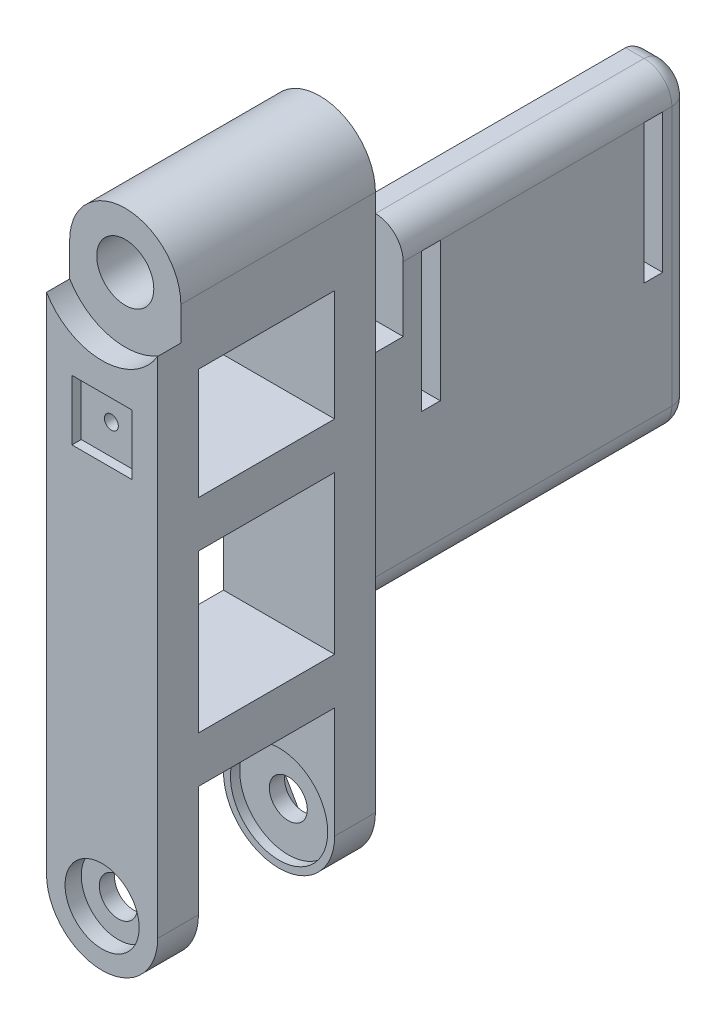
ISO-10303-21;
HEADER;
FILE_DESCRIPTION(('STEP AP214'),'2;1');
FILE_NAME('part.step','',(''),(''),'','','');
FILE_SCHEMA(('AUTOMOTIVE_DESIGN { 1 0 10303 214 1 1 1 1 }'));
ENDSEC;
DATA;
#1=APPLICATION_CONTEXT('core data for automotive mechanical design processes');
#2=APPLICATION_PROTOCOL_DEFINITION('international standard','automotive_design',2000,#1);
#3=PRODUCT_CONTEXT('',#1,'mechanical');
#4=PRODUCT('Part','Part','',(#3));
#5=PRODUCT_RELATED_PRODUCT_CATEGORY('part','',(#4));
#6=PRODUCT_DEFINITION_FORMATION('','',#4);
#7=PRODUCT_DEFINITION_CONTEXT('part definition',#1,'design');
#8=PRODUCT_DEFINITION('design','',#6,#7);
#9=PRODUCT_DEFINITION_SHAPE('','',#8);
#10=(LENGTH_UNIT() NAMED_UNIT(*) SI_UNIT(.MILLI.,.METRE.));
#11=(NAMED_UNIT(*) PLANE_ANGLE_UNIT() SI_UNIT($,.RADIAN.));
#12=(NAMED_UNIT(*) SI_UNIT($,.STERADIAN.) SOLID_ANGLE_UNIT());
#13=UNCERTAINTY_MEASURE_WITH_UNIT(LENGTH_MEASURE(1.E-05),#10,'distance_accuracy_value','');
#14=(GEOMETRIC_REPRESENTATION_CONTEXT(3) GLOBAL_UNCERTAINTY_ASSIGNED_CONTEXT((#13)) GLOBAL_UNIT_ASSIGNED_CONTEXT((#10,
#11,#12)) REPRESENTATION_CONTEXT('',''));
#15=CARTESIAN_POINT('',(0.,0.,0.));
#16=DIRECTION('',(0.,0.,1.));
#17=DIRECTION('',(1.,0.,0.));
#18=AXIS2_PLACEMENT_3D('',#15,#16,#17);
#19=CARTESIAN_POINT('',(0.,36.,-65.5));
#20=DIRECTION('',(0.,-1.,0.));
#21=DIRECTION('',(0.,0.,-1.));
#22=AXIS2_PLACEMENT_3D('',#19,#20,#21);
#23=PLANE('',#22);
#24=DIRECTION('',(1.,0.,0.));
#25=VECTOR('',#24,1.);
#26=CARTESIAN_POINT('',(0.,36.,-34.5));
#27=LINE('',#26,#25);
#28=CARTESIAN_POINT('',(0.,36.,-34.5));
#29=VERTEX_POINT('',#28);
#30=CARTESIAN_POINT('',(4.99999999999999,36.,-34.5));
#31=VERTEX_POINT('',#30);
#32=EDGE_CURVE('E453',#29,#31,#27,.T.);
#33=ORIENTED_EDGE('',*,*,#32,.F.);
#34=DIRECTION('',(0.,0.,1.));
#35=VECTOR('',#34,1.);
#36=CARTESIAN_POINT('',(0.,36.,-65.5));
#37=LINE('',#36,#35);
#38=CARTESIAN_POINT('',(0.,36.,-24.5));
#39=VERTEX_POINT('',#38);
#40=EDGE_CURVE('E539',#29,#39,#37,.T.);
#41=ORIENTED_EDGE('',*,*,#40,.T.);
#42=DIRECTION('',(-1.,0.,0.));
#43=VECTOR('',#42,1.);
#44=CARTESIAN_POINT('',(0.,36.,-24.5));
#45=LINE('',#44,#43);
#46=CARTESIAN_POINT('',(4.99999999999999,36.,-24.5));
#47=VERTEX_POINT('',#46);
#48=EDGE_CURVE('E513',#47,#39,#45,.T.);
#49=ORIENTED_EDGE('',*,*,#48,.F.);
#50=DIRECTION('',(0.,0.,1.));
#51=VECTOR('',#50,1.);
#52=CARTESIAN_POINT('',(4.99999999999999,36.,-65.5));
#53=LINE('',#52,#51);
#54=EDGE_CURVE('E536',#31,#47,#53,.T.);
#55=ORIENTED_EDGE('',*,*,#54,.F.);
#56=EDGE_LOOP('',(#33,#41,#49,#55));
#57=FACE_BOUND('',#56,.T.);
#58=ADVANCED_FACE('F44',(#57),#23,.F.);
#59=CARTESIAN_POINT('',(0.,0.,-25.5));
#60=DIRECTION('',(-1.,0.,0.));
#61=DIRECTION('',(0.,-1.,0.));
#62=AXIS2_PLACEMENT_3D('',#59,#60,#61);
#63=PLANE('',#62);
#64=DIRECTION('',(0.,1.,0.));
#65=VECTOR('',#64,1.);
#66=CARTESIAN_POINT('',(0.,0.,-36.5));
#67=LINE('',#66,#65);
#68=CARTESIAN_POINT('',(0.,28.,-36.5));
#69=VERTEX_POINT('',#68);
#70=CARTESIAN_POINT('',(0.,43.,-36.5));
#71=VERTEX_POINT('',#70);
#72=EDGE_CURVE('E451',#69,#71,#67,.T.);
#73=ORIENTED_EDGE('',*,*,#72,.F.);
#74=DIRECTION('',(0.,0.,1.));
#75=VECTOR('',#74,1.);
#76=CARTESIAN_POINT('',(0.,28.,-25.5));
#77=LINE('',#76,#75);
#78=CARTESIAN_POINT('',(0.,28.,-38.5));
#79=VERTEX_POINT('',#78);
#80=EDGE_CURVE('E444',#79,#69,#77,.T.);
#81=ORIENTED_EDGE('',*,*,#80,.F.);
#82=DIRECTION('',(0.,-1.,0.));
#83=VECTOR('',#82,1.);
#84=CARTESIAN_POINT('',(0.,0.,-38.5));
#85=LINE('',#84,#83);
#86=CARTESIAN_POINT('',(0.,43.,-38.5));
#87=VERTEX_POINT('',#86);
#88=EDGE_CURVE('E446',#87,#79,#85,.T.);
#89=ORIENTED_EDGE('',*,*,#88,.F.);
#90=DIRECTION('',(0.,0.,-1.));
#91=VECTOR('',#90,1.);
#92=CARTESIAN_POINT('',(0.,43.,-25.5));
#93=LINE('',#92,#91);
#94=EDGE_CURVE('E449',#71,#87,#93,.T.);
#95=ORIENTED_EDGE('',*,*,#94,.F.);
#96=EDGE_LOOP('',(#73,#81,#89,#95));
#97=FACE_BOUND('',#96,.T.);
#98=DIRECTION('',(0.,1.,0.));
#99=VECTOR('',#98,1.);
#100=CARTESIAN_POINT('',(0.,0.,-60.5));
#101=LINE('',#100,#99);
#102=CARTESIAN_POINT('',(0.,28.,-60.5));
#103=VERTEX_POINT('',#102);
#104=CARTESIAN_POINT('',(0.,43.,-60.5));
#105=VERTEX_POINT('',#104);
#106=EDGE_CURVE('E442',#103,#105,#101,.T.);
#107=ORIENTED_EDGE('',*,*,#106,.F.);
#108=DIRECTION('',(0.,0.,1.));
#109=VECTOR('',#108,1.);
#110=CARTESIAN_POINT('',(0.,28.,-25.5));
#111=LINE('',#110,#109);
#112=CARTESIAN_POINT('',(0.,28.,-62.5));
#113=VERTEX_POINT('',#112);
#114=EDGE_CURVE('E408',#113,#103,#111,.T.);
#115=ORIENTED_EDGE('',*,*,#114,.F.);
#116=DIRECTION('',(0.,-1.,0.));
#117=VECTOR('',#116,1.);
#118=CARTESIAN_POINT('',(0.,0.,-62.5));
#119=LINE('',#118,#117);
#120=CARTESIAN_POINT('',(0.,43.,-62.5));
#121=VERTEX_POINT('',#120);
#122=EDGE_CURVE('E437',#121,#113,#119,.T.);
#123=ORIENTED_EDGE('',*,*,#122,.F.);
#124=DIRECTION('',(0.,0.,-1.));
#125=VECTOR('',#124,1.);
#126=CARTESIAN_POINT('',(0.,43.,-25.5));
#127=LINE('',#126,#125);
#128=EDGE_CURVE('E440',#105,#121,#127,.T.);
#129=ORIENTED_EDGE('',*,*,#128,.F.);
#130=EDGE_LOOP('',(#107,#115,#123,#129));
#131=FACE_BOUND('',#130,.T.);
#132=DIRECTION('',(0.,1.,0.));
#133=VECTOR('',#132,1.);
#134=CARTESIAN_POINT('',(0.,0.,-5.4));
#135=LINE('',#134,#133);
#136=CARTESIAN_POINT('',(0.,17.,-5.4));
#137=VERTEX_POINT('',#136);
#138=CARTESIAN_POINT('',(0.,34.,-5.4));
#139=VERTEX_POINT('',#138);
#140=EDGE_CURVE('E653',#137,#139,#135,.T.);
#141=ORIENTED_EDGE('',*,*,#140,.F.);
#142=DIRECTION('',(0.,0.,1.));
#143=VECTOR('',#142,1.);
#144=CARTESIAN_POINT('',(0.,17.,-25.5));
#145=LINE('',#144,#143);
#146=CARTESIAN_POINT('',(0.,17.,-20.1));
#147=VERTEX_POINT('',#146);
#148=EDGE_CURVE('E646',#147,#137,#145,.T.);
#149=ORIENTED_EDGE('',*,*,#148,.F.);
#150=DIRECTION('',(0.,-1.,0.));
#151=VECTOR('',#150,1.);
#152=CARTESIAN_POINT('',(0.,0.,-20.1));
#153=LINE('',#152,#151);
#154=CARTESIAN_POINT('',(0.,34.,-20.1));
#155=VERTEX_POINT('',#154);
#156=EDGE_CURVE('E648',#155,#147,#153,.T.);
#157=ORIENTED_EDGE('',*,*,#156,.F.);
#158=DIRECTION('',(0.,0.,-1.));
#159=VECTOR('',#158,1.);
#160=CARTESIAN_POINT('',(0.,34.,-25.5));
#161=LINE('',#160,#159);
#162=EDGE_CURVE('E651',#139,#155,#161,.T.);
#163=ORIENTED_EDGE('',*,*,#162,.F.);
#164=EDGE_LOOP('',(#141,#149,#157,#163));
#165=FACE_BOUND('',#164,.T.);
#166=DIRECTION('',(0.,1.,0.));
#167=VECTOR('',#166,1.);
#168=CARTESIAN_POINT('',(0.,0.,-5.4));
#169=LINE('',#168,#167);
#170=CARTESIAN_POINT('',(0.,39.,-5.4));
#171=VERTEX_POINT('',#170);
#172=CARTESIAN_POINT('',(0.,51.,-5.4));
#173=VERTEX_POINT('',#172);
#174=EDGE_CURVE('E644',#171,#173,#169,.T.);
#175=ORIENTED_EDGE('',*,*,#174,.F.);
#176=DIRECTION('',(0.,0.,1.));
#177=VECTOR('',#176,1.);
#178=CARTESIAN_POINT('',(0.,39.,-25.5));
#179=LINE('',#178,#177);
#180=CARTESIAN_POINT('',(0.,39.,-20.1));
#181=VERTEX_POINT('',#180);
#182=EDGE_CURVE('E637',#181,#171,#179,.T.);
#183=ORIENTED_EDGE('',*,*,#182,.F.);
#184=DIRECTION('',(0.,-1.,0.));
#185=VECTOR('',#184,1.);
#186=CARTESIAN_POINT('',(0.,0.,-20.1));
#187=LINE('',#186,#185);
#188=CARTESIAN_POINT('',(0.,51.,-20.1));
#189=VERTEX_POINT('',#188);
#190=EDGE_CURVE('E639',#189,#181,#187,.T.);
#191=ORIENTED_EDGE('',*,*,#190,.F.);
#192=DIRECTION('',(0.,0.,-1.));
#193=VECTOR('',#192,1.);
#194=CARTESIAN_POINT('',(0.,51.,-25.5));
#195=LINE('',#194,#193);
#196=EDGE_CURVE('E642',#173,#189,#195,.T.);
#197=ORIENTED_EDGE('',*,*,#196,.F.);
#198=EDGE_LOOP('',(#175,#183,#191,#197));
#199=FACE_BOUND('',#198,.T.);
#200=DIRECTION('',(0.,0.,1.));
#201=VECTOR('',#200,1.);
#202=CARTESIAN_POINT('',(0.,46.,-65.5));
#203=LINE('',#202,#201);
#204=CARTESIAN_POINT('',(0.,46.,-63.5));
#205=VERTEX_POINT('',#204);
#206=CARTESIAN_POINT('',(0.,46.,-34.5));
#207=VERTEX_POINT('',#206);
#208=EDGE_CURVE('E454',#205,#207,#203,.T.);
#209=ORIENTED_EDGE('',*,*,#208,.F.);
#210=DIRECTION('',(0.,1.,0.));
#211=VECTOR('',#210,1.);
#212=CARTESIAN_POINT('',(0.,0.,-63.5));
#213=LINE('',#212,#211);
#214=CARTESIAN_POINT('',(0.,12.,-63.5));
#215=VERTEX_POINT('',#214);
#216=EDGE_CURVE('E11',#205,#215,#213,.F.);
#217=ORIENTED_EDGE('',*,*,#216,.T.);
#218=DIRECTION('',(0.,0.,1.));
#219=VECTOR('',#218,1.);
#220=CARTESIAN_POINT('',(0.,12.,-65.5));
#221=LINE('',#220,#219);
#222=CARTESIAN_POINT('',(0.,12.,-24.5));
#223=VERTEX_POINT('',#222);
#224=EDGE_CURVE('E541',#215,#223,#221,.T.);
#225=ORIENTED_EDGE('',*,*,#224,.T.);
#226=DIRECTION('',(0.,1.,0.));
#227=VECTOR('',#226,1.);
#228=CARTESIAN_POINT('',(0.,12.,-24.5));
#229=LINE('',#228,#227);
#230=CARTESIAN_POINT('',(0.,0.,-24.5));
#231=VERTEX_POINT('',#230);
#232=EDGE_CURVE('E505',#231,#223,#229,.T.);
#233=ORIENTED_EDGE('',*,*,#232,.F.);
#234=DIRECTION('',(0.,0.,1.));
#235=VECTOR('',#234,1.);
#236=CARTESIAN_POINT('',(0.,0.,-25.5));
#237=LINE('',#236,#235);
#238=CARTESIAN_POINT('',(0.,0.,-20.1));
#239=VERTEX_POINT('',#238);
#240=EDGE_CURVE('E658',#231,#239,#237,.T.);
#241=ORIENTED_EDGE('',*,*,#240,.T.);
#242=DIRECTION('',(0.,-1.,0.));
#243=VECTOR('',#242,1.);
#244=CARTESIAN_POINT('',(0.,0.,-20.1));
#245=LINE('',#244,#243);
#246=CARTESIAN_POINT('',(0.,12.,-20.1));
#247=VERTEX_POINT('',#246);
#248=EDGE_CURVE('E586',#247,#239,#245,.T.);
#249=ORIENTED_EDGE('',*,*,#248,.F.);
#250=DIRECTION('',(0.,0.,-1.));
#251=VECTOR('',#250,1.);
#252=CARTESIAN_POINT('',(0.,12.,-25.5));
#253=LINE('',#252,#251);
#254=CARTESIAN_POINT('',(0.,12.,-5.4));
#255=VERTEX_POINT('',#254);
#256=EDGE_CURVE('E655',#255,#247,#253,.T.);
#257=ORIENTED_EDGE('',*,*,#256,.F.);
#258=DIRECTION('',(0.,1.,0.));
#259=VECTOR('',#258,1.);
#260=CARTESIAN_POINT('',(0.,0.,-5.4));
#261=LINE('',#260,#259);
#262=CARTESIAN_POINT('',(0.,0.,-5.4));
#263=VERTEX_POINT('',#262);
#264=EDGE_CURVE('E633',#263,#255,#261,.T.);
#265=ORIENTED_EDGE('',*,*,#264,.F.);
#266=CARTESIAN_POINT('',(0.,0.,-1.));
#267=VERTEX_POINT('',#266);
#268=EDGE_CURVE('E661',#263,#267,#237,.T.);
#269=ORIENTED_EDGE('',*,*,#268,.T.);
#270=DIRECTION('',(0.,-1.,0.));
#271=VECTOR('',#270,1.);
#272=CARTESIAN_POINT('',(0.,54.394448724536,-1.));
#273=LINE('',#272,#271);
#274=CARTESIAN_POINT('',(0.,54.394448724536,-1.));
#275=VERTEX_POINT('',#274);
#276=EDGE_CURVE('E487',#275,#267,#273,.T.);
#277=ORIENTED_EDGE('',*,*,#276,.F.);
#278=DIRECTION('',(0.,0.,1.));
#279=VECTOR('',#278,1.);
#280=CARTESIAN_POINT('',(0.,54.394448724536,-3.5));
#281=LINE('',#280,#279);
#282=CARTESIAN_POINT('',(0.,54.394448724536,-3.5));
#283=VERTEX_POINT('',#282);
#284=EDGE_CURVE('E533',#283,#275,#281,.T.);
#285=ORIENTED_EDGE('',*,*,#284,.F.);
#286=DIRECTION('',(0.,1.,0.));
#287=VECTOR('',#286,1.);
#288=CARTESIAN_POINT('',(0.,0.,-3.5));
#289=LINE('',#288,#287);
#290=CARTESIAN_POINT('',(0.,58.,-3.5));
#291=VERTEX_POINT('',#290);
#292=EDGE_CURVE('E528',#283,#291,#289,.T.);
#293=ORIENTED_EDGE('',*,*,#292,.T.);
#294=DIRECTION('',(0.,0.,1.));
#295=VECTOR('',#294,1.);
#296=CARTESIAN_POINT('',(0.,58.,-25.5));
#297=LINE('',#296,#295);
#298=CARTESIAN_POINT('',(0.,58.,-24.5));
#299=VERTEX_POINT('',#298);
#300=EDGE_CURVE('E662',#299,#291,#297,.T.);
#301=ORIENTED_EDGE('',*,*,#300,.F.);
#302=DIRECTION('',(0.,1.,0.));
#303=VECTOR('',#302,1.);
#304=CARTESIAN_POINT('',(0.,54.394448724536,-24.5));
#305=LINE('',#304,#303);
#306=EDGE_CURVE('E516',#39,#299,#305,.T.);
#307=ORIENTED_EDGE('',*,*,#306,.F.);
#308=ORIENTED_EDGE('',*,*,#40,.F.);
#309=DIRECTION('',(0.,-1.,0.));
#310=VECTOR('',#309,1.);
#311=CARTESIAN_POINT('',(0.,46.,-34.5));
#312=LINE('',#311,#310);
#313=EDGE_CURVE('E463',#207,#29,#312,.T.);
#314=ORIENTED_EDGE('',*,*,#313,.F.);
#315=EDGE_LOOP('',(#209,#217,#225,#233,#241,#249,#257,#265,#269,#277,#285,#293,#301,#307,#308,#314));
#316=FACE_BOUND('',#315,.T.);
#317=ADVANCED_FACE('F758',(#97,#131,#165,#199,#316),#63,.T.);
#318=CARTESIAN_POINT('',(12.,0.,-25.5));
#319=DIRECTION('',(1.,0.,0.));
#320=DIRECTION('',(0.,1.,0.));
#321=AXIS2_PLACEMENT_3D('',#318,#319,#320);
#322=PLANE('',#321);
#323=DIRECTION('',(0.,-1.,0.));
#324=VECTOR('',#323,1.);
#325=CARTESIAN_POINT('',(12.,17.,-5.4));
#326=LINE('',#325,#324);
#327=CARTESIAN_POINT('',(12.,34.,-5.4));
#328=VERTEX_POINT('',#327);
#329=CARTESIAN_POINT('',(12.,17.,-5.4));
#330=VERTEX_POINT('',#329);
#331=EDGE_CURVE('E588',#328,#330,#326,.T.);
#332=ORIENTED_EDGE('',*,*,#331,.F.);
#333=DIRECTION('',(0.,0.,1.));
#334=VECTOR('',#333,1.);
#335=CARTESIAN_POINT('',(12.,34.,-5.4));
#336=LINE('',#335,#334);
#337=CARTESIAN_POINT('',(12.,34.,-20.1));
#338=VERTEX_POINT('',#337);
#339=EDGE_CURVE('E597',#338,#328,#336,.T.);
#340=ORIENTED_EDGE('',*,*,#339,.F.);
#341=DIRECTION('',(0.,1.,0.));
#342=VECTOR('',#341,1.);
#343=CARTESIAN_POINT('',(12.,17.,-20.1));
#344=LINE('',#343,#342);
#345=CARTESIAN_POINT('',(12.,17.,-20.1));
#346=VERTEX_POINT('',#345);
#347=EDGE_CURVE('E594',#346,#338,#344,.T.);
#348=ORIENTED_EDGE('',*,*,#347,.F.);
#349=DIRECTION('',(0.,0.,-1.));
#350=VECTOR('',#349,1.);
#351=CARTESIAN_POINT('',(12.,17.,-5.4));
#352=LINE('',#351,#350);
#353=EDGE_CURVE('E590',#330,#346,#352,.T.);
#354=ORIENTED_EDGE('',*,*,#353,.F.);
#355=EDGE_LOOP('',(#332,#340,#348,#354));
#356=FACE_BOUND('',#355,.T.);
#357=DIRECTION('',(0.,-1.,0.));
#358=VECTOR('',#357,1.);
#359=CARTESIAN_POINT('',(12.,39.,-5.4));
#360=LINE('',#359,#358);
#361=CARTESIAN_POINT('',(12.,51.,-5.4));
#362=VERTEX_POINT('',#361);
#363=CARTESIAN_POINT('',(12.,39.,-5.4));
#364=VERTEX_POINT('',#363);
#365=EDGE_CURVE('E608',#362,#364,#360,.T.);
#366=ORIENTED_EDGE('',*,*,#365,.F.);
#367=DIRECTION('',(0.,0.,1.));
#368=VECTOR('',#367,1.);
#369=CARTESIAN_POINT('',(12.,51.,-5.4));
#370=LINE('',#369,#368);
#371=CARTESIAN_POINT('',(12.,51.,-20.1));
#372=VERTEX_POINT('',#371);
#373=EDGE_CURVE('E617',#372,#362,#370,.T.);
#374=ORIENTED_EDGE('',*,*,#373,.F.);
#375=DIRECTION('',(0.,1.,0.));
#376=VECTOR('',#375,1.);
#377=CARTESIAN_POINT('',(12.,39.,-20.1));
#378=LINE('',#377,#376);
#379=CARTESIAN_POINT('',(12.,39.,-20.1));
#380=VERTEX_POINT('',#379);
#381=EDGE_CURVE('E614',#380,#372,#378,.T.);
#382=ORIENTED_EDGE('',*,*,#381,.F.);
#383=DIRECTION('',(0.,0.,-1.));
#384=VECTOR('',#383,1.);
#385=CARTESIAN_POINT('',(12.,39.,-5.4));
#386=LINE('',#385,#384);
#387=EDGE_CURVE('E610',#364,#380,#386,.T.);
#388=ORIENTED_EDGE('',*,*,#387,.F.);
#389=EDGE_LOOP('',(#366,#374,#382,#388));
#390=FACE_BOUND('',#389,.T.);
#391=DIRECTION('',(0.,-1.,0.));
#392=VECTOR('',#391,1.);
#393=CARTESIAN_POINT('',(12.,54.394448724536,-24.5));
#394=LINE('',#393,#392);
#395=CARTESIAN_POINT('',(12.,58.,-24.5));
#396=VERTEX_POINT('',#395);
#397=CARTESIAN_POINT('',(12.,0.,-24.5));
#398=VERTEX_POINT('',#397);
#399=EDGE_CURVE('E501',#396,#398,#394,.T.);
#400=ORIENTED_EDGE('',*,*,#399,.F.);
#401=DIRECTION('',(0.,0.,1.));
#402=VECTOR('',#401,1.);
#403=CARTESIAN_POINT('',(12.,58.,-25.5));
#404=LINE('',#403,#402);
#405=CARTESIAN_POINT('',(12.,58.,-3.5));
#406=VERTEX_POINT('',#405);
#407=EDGE_CURVE('E664',#396,#406,#404,.T.);
#408=ORIENTED_EDGE('',*,*,#407,.T.);
#409=DIRECTION('',(0.,-1.,0.));
#410=VECTOR('',#409,1.);
#411=CARTESIAN_POINT('',(12.,0.,-3.5));
#412=LINE('',#411,#410);
#413=CARTESIAN_POINT('',(12.,54.394448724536,-3.5));
#414=VERTEX_POINT('',#413);
#415=EDGE_CURVE('E522',#406,#414,#412,.T.);
#416=ORIENTED_EDGE('',*,*,#415,.T.);
#417=DIRECTION('',(0.,0.,1.));
#418=VECTOR('',#417,1.);
#419=CARTESIAN_POINT('',(12.,54.394448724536,-3.5));
#420=LINE('',#419,#418);
#421=CARTESIAN_POINT('',(12.,54.394448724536,-1.));
#422=VERTEX_POINT('',#421);
#423=EDGE_CURVE('E531',#422,#414,#420,.F.);
#424=ORIENTED_EDGE('',*,*,#423,.F.);
#425=DIRECTION('',(0.,1.,0.));
#426=VECTOR('',#425,1.);
#427=CARTESIAN_POINT('',(12.,54.394448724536,-1.));
#428=LINE('',#427,#426);
#429=CARTESIAN_POINT('',(12.,0.,-1.));
#430=VERTEX_POINT('',#429);
#431=EDGE_CURVE('E491',#430,#422,#428,.T.);
#432=ORIENTED_EDGE('',*,*,#431,.F.);
#433=DIRECTION('',(0.,0.,1.));
#434=VECTOR('',#433,1.);
#435=CARTESIAN_POINT('',(12.,0.,-25.5));
#436=LINE('',#435,#434);
#437=CARTESIAN_POINT('',(12.,0.,-5.4));
#438=VERTEX_POINT('',#437);
#439=EDGE_CURVE('E657',#438,#430,#436,.T.);
#440=ORIENTED_EDGE('',*,*,#439,.F.);
#441=DIRECTION('',(0.,-1.,0.));
#442=VECTOR('',#441,1.);
#443=CARTESIAN_POINT('',(12.,-6.,-5.4));
#444=LINE('',#443,#442);
#445=CARTESIAN_POINT('',(12.,12.,-5.4));
#446=VERTEX_POINT('',#445);
#447=EDGE_CURVE('E574',#446,#438,#444,.T.);
#448=ORIENTED_EDGE('',*,*,#447,.F.);
#449=DIRECTION('',(0.,0.,1.));
#450=VECTOR('',#449,1.);
#451=CARTESIAN_POINT('',(12.,12.,-5.4));
#452=LINE('',#451,#450);
#453=CARTESIAN_POINT('',(12.,12.,-20.1));
#454=VERTEX_POINT('',#453);
#455=EDGE_CURVE('E580',#454,#446,#452,.T.);
#456=ORIENTED_EDGE('',*,*,#455,.F.);
#457=DIRECTION('',(0.,1.,0.));
#458=VECTOR('',#457,1.);
#459=CARTESIAN_POINT('',(12.,-6.,-20.1));
#460=LINE('',#459,#458);
#461=CARTESIAN_POINT('',(12.,0.,-20.1));
#462=VERTEX_POINT('',#461);
#463=EDGE_CURVE('E576',#462,#454,#460,.T.);
#464=ORIENTED_EDGE('',*,*,#463,.F.);
#465=EDGE_CURVE('E666',#398,#462,#436,.T.);
#466=ORIENTED_EDGE('',*,*,#465,.F.);
#467=EDGE_LOOP('',(#400,#408,#416,#424,#432,#440,#448,#456,#464,#466));
#468=FACE_BOUND('',#467,.T.);
#469=ADVANCED_FACE('F831',(#356,#390,#468),#322,.T.);
#470=CARTESIAN_POINT('',(5.99999999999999,58.,-25.5));
#471=DIRECTION('',(0.,0.,1.));
#472=DIRECTION('',(1.,0.,0.));
#473=AXIS2_PLACEMENT_3D('',#470,#471,#472);
#474=CYLINDRICAL_SURFACE('',#473,6.);
#475=ORIENTED_EDGE('',*,*,#407,.F.);
#476=CARTESIAN_POINT('',(5.99999999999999,58.,-24.5));
#477=DIRECTION('',(0.,0.,-1.));
#478=DIRECTION('',(-1.,0.,0.));
#479=AXIS2_PLACEMENT_3D('',#476,#477,#478);
#480=CIRCLE('',#479,6.);
#481=EDGE_CURVE('E468',#396,#299,#480,.F.);
#482=ORIENTED_EDGE('',*,*,#481,.T.);
#483=ORIENTED_EDGE('',*,*,#300,.T.);
#484=CARTESIAN_POINT('',(5.99999999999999,58.,-3.5));
#485=DIRECTION('',(0.,0.,1.));
#486=DIRECTION('',(1.,0.,0.));
#487=AXIS2_PLACEMENT_3D('',#484,#485,#486);
#488=CIRCLE('',#487,6.);
#489=EDGE_CURVE('E525',#291,#406,#488,.F.);
#490=ORIENTED_EDGE('',*,*,#489,.T.);
#491=EDGE_LOOP('',(#475,#482,#483,#490));
#492=FACE_BOUND('',#491,.T.);
#493=ADVANCED_FACE('F928',(#492),#474,.T.);
#494=CARTESIAN_POINT('',(5.99999999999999,58.,-25.5));
#495=DIRECTION('',(0.,0.,1.));
#496=DIRECTION('',(1.,0.,0.));
#497=AXIS2_PLACEMENT_3D('',#494,#495,#496);
#498=CYLINDRICAL_SURFACE('',#497,3.08);
#499=CARTESIAN_POINT('',(5.99999999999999,58.,-3.5));
#500=DIRECTION('',(0.,0.,1.));
#501=DIRECTION('',(1.,0.,0.));
#502=AXIS2_PLACEMENT_3D('',#499,#500,#501);
#503=CIRCLE('',#502,3.08);
#504=CARTESIAN_POINT('',(9.07999999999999,58.,-3.5));
#505=VERTEX_POINT('',#504);
#506=EDGE_CURVE('E521',#505,#505,#503,.F.);
#507=ORIENTED_EDGE('',*,*,#506,.F.);
#508=EDGE_LOOP('',(#507));
#509=FACE_BOUND('',#508,.T.);
#510=CARTESIAN_POINT('',(5.99999999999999,58.,-24.5));
#511=DIRECTION('',(0.,0.,-1.));
#512=DIRECTION('',(-1.,0.,0.));
#513=AXIS2_PLACEMENT_3D('',#510,#511,#512);
#514=CIRCLE('',#513,3.08);
#515=CARTESIAN_POINT('',(2.91999999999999,58.,-24.5));
#516=VERTEX_POINT('',#515);
#517=EDGE_CURVE('E465',#516,#516,#514,.F.);
#518=ORIENTED_EDGE('',*,*,#517,.F.);
#519=EDGE_LOOP('',(#518));
#520=FACE_BOUND('',#519,.T.);
#521=ADVANCED_FACE('F926',(#509,#520),#498,.F.);
#522=CARTESIAN_POINT('',(6.,0.,-25.5));
#523=DIRECTION('',(0.,0.,1.));
#524=DIRECTION('',(1.,0.,0.));
#525=AXIS2_PLACEMENT_3D('',#522,#523,#524);
#526=CYLINDRICAL_SURFACE('',#525,2.05);
#527=CARTESIAN_POINT('',(6.,0.,-2.75));
#528=DIRECTION('',(0.,0.,1.));
#529=DIRECTION('',(1.,0.,0.));
#530=AXIS2_PLACEMENT_3D('',#527,#528,#529);
#531=CIRCLE('',#530,2.05);
#532=CARTESIAN_POINT('',(8.05,0.,-2.75));
#533=VERTEX_POINT('',#532);
#534=EDGE_CURVE('E611',#533,#533,#531,.F.);
#535=ORIENTED_EDGE('',*,*,#534,.F.);
#536=EDGE_LOOP('',(#535));
#537=FACE_BOUND('',#536,.T.);
#538=CARTESIAN_POINT('',(6.,0.,-4.4));
#539=DIRECTION('',(0.,0.,-1.));
#540=DIRECTION('',(-1.,0.,0.));
#541=AXIS2_PLACEMENT_3D('',#538,#539,#540);
#542=CIRCLE('',#541,2.05);
#543=CARTESIAN_POINT('',(3.95,0.,-4.4));
#544=VERTEX_POINT('',#543);
#545=EDGE_CURVE('E475',#544,#544,#542,.F.);
#546=ORIENTED_EDGE('',*,*,#545,.F.);
#547=EDGE_LOOP('',(#546));
#548=FACE_BOUND('',#547,.T.);
#549=ADVANCED_FACE('F924',(#537,#548),#526,.F.);
#550=CARTESIAN_POINT('',(6.,0.,-22.75));
#551=DIRECTION('',(0.,0.,-1.));
#552=DIRECTION('',(-1.,0.,0.));
#553=AXIS2_PLACEMENT_3D('',#550,#551,#552);
#554=CIRCLE('',#553,2.05);
#555=CARTESIAN_POINT('',(3.95,0.,-22.75));
#556=VERTEX_POINT('',#555);
#557=EDGE_CURVE('E565',#556,#556,#554,.F.);
#558=ORIENTED_EDGE('',*,*,#557,.F.);
#559=EDGE_LOOP('',(#558));
#560=FACE_BOUND('',#559,.T.);
#561=CARTESIAN_POINT('',(6.,0.,-21.1));
#562=DIRECTION('',(0.,0.,1.));
#563=DIRECTION('',(1.,0.,0.));
#564=AXIS2_PLACEMENT_3D('',#561,#562,#563);
#565=CIRCLE('',#564,2.05);
#566=CARTESIAN_POINT('',(8.05,0.,-21.1));
#567=VERTEX_POINT('',#566);
#568=EDGE_CURVE('E481',#567,#567,#565,.F.);
#569=ORIENTED_EDGE('',*,*,#568,.F.);
#570=EDGE_LOOP('',(#569));
#571=FACE_BOUND('',#570,.T.);
#572=ADVANCED_FACE('F921',(#560,#571),#526,.F.);
#573=CARTESIAN_POINT('',(6.,0.,-25.5));
#574=DIRECTION('',(0.,0.,1.));
#575=DIRECTION('',(1.,0.,0.));
#576=AXIS2_PLACEMENT_3D('',#573,#574,#575);
#577=CYLINDRICAL_SURFACE('',#576,6.);
#578=ORIENTED_EDGE('',*,*,#439,.T.);
#579=CARTESIAN_POINT('',(6.,0.,-1.));
#580=DIRECTION('',(0.,0.,1.));
#581=DIRECTION('',(1.,0.,0.));
#582=AXIS2_PLACEMENT_3D('',#579,#580,#581);
#583=CIRCLE('',#582,6.);
#584=EDGE_CURVE('E489',#267,#430,#583,.T.);
#585=ORIENTED_EDGE('',*,*,#584,.F.);
#586=ORIENTED_EDGE('',*,*,#268,.F.);
#587=CARTESIAN_POINT('',(6.,0.,-5.4));
#588=DIRECTION('',(0.,0.,1.));
#589=DIRECTION('',(1.,0.,0.));
#590=AXIS2_PLACEMENT_3D('',#587,#588,#589);
#591=CIRCLE('',#590,6.);
#592=EDGE_CURVE('E635',#438,#263,#591,.F.);
#593=ORIENTED_EDGE('',*,*,#592,.F.);
#594=EDGE_LOOP('',(#578,#585,#586,#593));
#595=FACE_BOUND('',#594,.T.);
#596=ADVANCED_FACE('F867',(#595),#577,.T.);
#597=CARTESIAN_POINT('',(2.74999999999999,48.,-2.));
#598=DIRECTION('',(-1.,0.,0.));
#599=DIRECTION('',(0.,-1.,0.));
#600=AXIS2_PLACEMENT_3D('',#597,#598,#599);
#601=PLANE('',#600);
#602=DIRECTION('',(0.,1.,0.));
#603=VECTOR('',#602,1.);
#604=CARTESIAN_POINT('',(2.74999999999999,48.,-1.));
#605=LINE('',#604,#603);
#606=CARTESIAN_POINT('',(2.74999999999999,41.5,-1.));
#607=VERTEX_POINT('',#606);
#608=CARTESIAN_POINT('',(2.74999999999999,48.,-1.));
#609=VERTEX_POINT('',#608);
#610=EDGE_CURVE('E499',#607,#609,#605,.T.);
#611=ORIENTED_EDGE('',*,*,#610,.F.);
#612=DIRECTION('',(0.,0.,1.));
#613=VECTOR('',#612,1.);
#614=CARTESIAN_POINT('',(2.74999999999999,41.5,-2.));
#615=LINE('',#614,#613);
#616=CARTESIAN_POINT('',(2.74999999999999,41.5,-2.));
#617=VERTEX_POINT('',#616);
#618=EDGE_CURVE('E561',#617,#607,#615,.T.);
#619=ORIENTED_EDGE('',*,*,#618,.F.);
#620=DIRECTION('',(0.,-1.,0.));
#621=VECTOR('',#620,1.);
#622=CARTESIAN_POINT('',(2.74999999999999,48.,-2.));
#623=LINE('',#622,#621);
#624=CARTESIAN_POINT('',(2.74999999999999,48.,-2.));
#625=VERTEX_POINT('',#624);
#626=EDGE_CURVE('E549',#625,#617,#623,.T.);
#627=ORIENTED_EDGE('',*,*,#626,.F.);
#628=DIRECTION('',(0.,0.,1.));
#629=VECTOR('',#628,1.);
#630=CARTESIAN_POINT('',(2.74999999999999,48.,-2.));
#631=LINE('',#630,#629);
#632=EDGE_CURVE('E562',#625,#609,#631,.T.);
#633=ORIENTED_EDGE('',*,*,#632,.T.);
#634=EDGE_LOOP('',(#611,#619,#627,#633));
#635=FACE_BOUND('',#634,.T.);
#636=ADVANCED_FACE('F855',(#635),#601,.F.);
#637=CARTESIAN_POINT('',(2.74999999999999,48.,-2.));
#638=DIRECTION('',(0.,1.,0.));
#639=DIRECTION('',(0.,0.,1.));
#640=AXIS2_PLACEMENT_3D('',#637,#638,#639);
#641=PLANE('',#640);
#642=DIRECTION('',(1.,0.,0.));
#643=VECTOR('',#642,1.);
#644=CARTESIAN_POINT('',(2.74999999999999,48.,-1.));
#645=LINE('',#644,#643);
#646=CARTESIAN_POINT('',(9.24999999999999,48.,-1.));
#647=VERTEX_POINT('',#646);
#648=EDGE_CURVE('E497',#609,#647,#645,.T.);
#649=ORIENTED_EDGE('',*,*,#648,.F.);
#650=ORIENTED_EDGE('',*,*,#632,.F.);
#651=DIRECTION('',(-1.,0.,0.));
#652=VECTOR('',#651,1.);
#653=CARTESIAN_POINT('',(2.74999999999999,48.,-2.));
#654=LINE('',#653,#652);
#655=CARTESIAN_POINT('',(9.24999999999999,48.,-2.));
#656=VERTEX_POINT('',#655);
#657=EDGE_CURVE('E558',#656,#625,#654,.T.);
#658=ORIENTED_EDGE('',*,*,#657,.F.);
#659=DIRECTION('',(0.,0.,1.));
#660=VECTOR('',#659,1.);
#661=CARTESIAN_POINT('',(9.24999999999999,48.,-2.));
#662=LINE('',#661,#660);
#663=EDGE_CURVE('E566',#656,#647,#662,.T.);
#664=ORIENTED_EDGE('',*,*,#663,.T.);
#665=EDGE_LOOP('',(#649,#650,#658,#664));
#666=FACE_BOUND('',#665,.T.);
#667=ADVANCED_FACE('F851',(#666),#641,.F.);
#668=CARTESIAN_POINT('',(9.24999999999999,48.,-2.));
#669=DIRECTION('',(1.,0.,0.));
#670=DIRECTION('',(0.,0.,-1.));
#671=AXIS2_PLACEMENT_3D('',#668,#669,#670);
#672=PLANE('',#671);
#673=DIRECTION('',(0.,-1.,0.));
#674=VECTOR('',#673,1.);
#675=CARTESIAN_POINT('',(9.24999999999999,48.,-1.));
#676=LINE('',#675,#674);
#677=CARTESIAN_POINT('',(9.24999999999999,41.5,-1.));
#678=VERTEX_POINT('',#677);
#679=EDGE_CURVE('E495',#647,#678,#676,.T.);
#680=ORIENTED_EDGE('',*,*,#679,.F.);
#681=ORIENTED_EDGE('',*,*,#663,.F.);
#682=DIRECTION('',(0.,1.,0.));
#683=VECTOR('',#682,1.);
#684=CARTESIAN_POINT('',(9.24999999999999,48.,-2.));
#685=LINE('',#684,#683);
#686=CARTESIAN_POINT('',(9.24999999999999,41.5,-2.));
#687=VERTEX_POINT('',#686);
#688=EDGE_CURVE('E555',#687,#656,#685,.T.);
#689=ORIENTED_EDGE('',*,*,#688,.F.);
#690=DIRECTION('',(0.,0.,1.));
#691=VECTOR('',#690,1.);
#692=CARTESIAN_POINT('',(9.24999999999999,41.5,-2.));
#693=LINE('',#692,#691);
#694=EDGE_CURVE('E569',#687,#678,#693,.T.);
#695=ORIENTED_EDGE('',*,*,#694,.T.);
#696=EDGE_LOOP('',(#680,#681,#689,#695));
#697=FACE_BOUND('',#696,.T.);
#698=ADVANCED_FACE('F854',(#697),#672,.F.);
#699=CARTESIAN_POINT('',(2.74999999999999,41.5,-2.));
#700=DIRECTION('',(0.,-1.,0.));
#701=DIRECTION('',(0.,0.,-1.));
#702=AXIS2_PLACEMENT_3D('',#699,#700,#701);
#703=PLANE('',#702);
#704=DIRECTION('',(-1.,0.,0.));
#705=VECTOR('',#704,1.);
#706=CARTESIAN_POINT('',(2.74999999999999,41.5,-1.));
#707=LINE('',#706,#705);
#708=EDGE_CURVE('E493',#678,#607,#707,.T.);
#709=ORIENTED_EDGE('',*,*,#708,.F.);
#710=ORIENTED_EDGE('',*,*,#694,.F.);
#711=DIRECTION('',(1.,0.,0.));
#712=VECTOR('',#711,1.);
#713=CARTESIAN_POINT('',(2.74999999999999,41.5,-2.));
#714=LINE('',#713,#712);
#715=EDGE_CURVE('E552',#617,#687,#714,.T.);
#716=ORIENTED_EDGE('',*,*,#715,.F.);
#717=ORIENTED_EDGE('',*,*,#618,.T.);
#718=EDGE_LOOP('',(#709,#710,#716,#717));
#719=FACE_BOUND('',#718,.T.);
#720=ADVANCED_FACE('F859',(#719),#703,.F.);
#721=CARTESIAN_POINT('',(5.99999999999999,58.,-3.5));
#722=DIRECTION('',(0.,0.,1.));
#723=DIRECTION('',(1.,0.,0.));
#724=AXIS2_PLACEMENT_3D('',#721,#722,#723);
#725=CYLINDRICAL_SURFACE('',#724,7.);
#726=CARTESIAN_POINT('',(5.99999999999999,58.,-1.));
#727=DIRECTION('',(0.,0.,-1.));
#728=DIRECTION('',(1.,0.,0.));
#729=AXIS2_PLACEMENT_3D('',#726,#727,#728);
#730=CIRCLE('',#729,7.);
#731=EDGE_CURVE('E485',#422,#275,#730,.T.);
#732=ORIENTED_EDGE('',*,*,#731,.F.);
#733=ORIENTED_EDGE('',*,*,#423,.T.);
#734=CARTESIAN_POINT('',(5.99999999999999,58.,-3.5));
#735=DIRECTION('',(0.,0.,1.));
#736=DIRECTION('',(1.,0.,0.));
#737=AXIS2_PLACEMENT_3D('',#734,#735,#736);
#738=CIRCLE('',#737,7.);
#739=EDGE_CURVE('E518',#283,#414,#738,.T.);
#740=ORIENTED_EDGE('',*,*,#739,.F.);
#741=ORIENTED_EDGE('',*,*,#284,.T.);
#742=EDGE_LOOP('',(#732,#733,#740,#741));
#743=FACE_BOUND('',#742,.T.);
#744=ADVANCED_FACE('F863',(#743),#725,.F.);
#745=ORIENTED_EDGE('',*,*,#240,.F.);
#746=CARTESIAN_POINT('',(6.,0.,-24.5));
#747=DIRECTION('',(0.,0.,-1.));
#748=DIRECTION('',(-1.,0.,0.));
#749=AXIS2_PLACEMENT_3D('',#746,#747,#748);
#750=CIRCLE('',#749,6.);
#751=EDGE_CURVE('E503',#398,#231,#750,.T.);
#752=ORIENTED_EDGE('',*,*,#751,.F.);
#753=ORIENTED_EDGE('',*,*,#465,.T.);
#754=CARTESIAN_POINT('',(6.,0.,-20.1));
#755=DIRECTION('',(0.,0.,-1.));
#756=DIRECTION('',(-1.,0.,0.));
#757=AXIS2_PLACEMENT_3D('',#754,#755,#756);
#758=CIRCLE('',#757,6.);
#759=EDGE_CURVE('E630',#239,#462,#758,.F.);
#760=ORIENTED_EDGE('',*,*,#759,.F.);
#761=EDGE_LOOP('',(#745,#752,#753,#760));
#762=FACE_BOUND('',#761,.T.);
#763=ADVANCED_FACE('F889',(#762),#577,.T.);
#764=CARTESIAN_POINT('',(-8.,-6.,-5.4));
#765=DIRECTION('',(0.,0.,1.));
#766=DIRECTION('',(1.,0.,0.));
#767=AXIS2_PLACEMENT_3D('',#764,#765,#766);
#768=PLANE('',#767);
#769=CARTESIAN_POINT('',(5.87035313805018,0.,-5.4));
#770=DIRECTION('',(0.,0.,-1.));
#771=DIRECTION('',(-1.,0.,0.));
#772=AXIS2_PLACEMENT_3D('',#769,#770,#771);
#773=CIRCLE('',#772,5.25);
#774=CARTESIAN_POINT('',(0.620353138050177,0.,-5.4));
#775=VERTEX_POINT('',#774);
#776=EDGE_CURVE('E471',#775,#775,#773,.T.);
#777=ORIENTED_EDGE('',*,*,#776,.F.);
#778=EDGE_LOOP('',(#777));
#779=FACE_BOUND('',#778,.T.);
#780=ORIENTED_EDGE('',*,*,#592,.T.);
#781=ORIENTED_EDGE('',*,*,#264,.T.);
#782=DIRECTION('',(1.,0.,0.));
#783=VECTOR('',#782,1.);
#784=CARTESIAN_POINT('',(-8.,12.,-5.4));
#785=LINE('',#784,#783);
#786=EDGE_CURVE('E584',#255,#446,#785,.T.);
#787=ORIENTED_EDGE('',*,*,#786,.T.);
#788=ORIENTED_EDGE('',*,*,#447,.T.);
#789=EDGE_LOOP('',(#780,#781,#787,#788));
#790=FACE_BOUND('',#789,.T.);
#791=ADVANCED_FACE('F885',(#779,#790),#768,.F.);
#792=CARTESIAN_POINT('',(-8.,-6.,-20.1));
#793=DIRECTION('',(0.,0.,-1.));
#794=DIRECTION('',(-1.,0.,0.));
#795=AXIS2_PLACEMENT_3D('',#792,#793,#794);
#796=PLANE('',#795);
#797=CARTESIAN_POINT('',(6.,0.,-20.1));
#798=DIRECTION('',(0.,0.,1.));
#799=DIRECTION('',(1.,0.,0.));
#800=AXIS2_PLACEMENT_3D('',#797,#798,#799);
#801=CIRCLE('',#800,5.25);
#802=CARTESIAN_POINT('',(11.25,0.,-20.1));
#803=VERTEX_POINT('',#802);
#804=EDGE_CURVE('E482',#803,#803,#801,.T.);
#805=ORIENTED_EDGE('',*,*,#804,.F.);
#806=EDGE_LOOP('',(#805));
#807=FACE_BOUND('',#806,.T.);
#808=ORIENTED_EDGE('',*,*,#759,.T.);
#809=ORIENTED_EDGE('',*,*,#463,.T.);
#810=DIRECTION('',(1.,0.,0.));
#811=VECTOR('',#810,1.);
#812=CARTESIAN_POINT('',(-8.,12.,-20.1));
#813=LINE('',#812,#811);
#814=EDGE_CURVE('E583',#247,#454,#813,.T.);
#815=ORIENTED_EDGE('',*,*,#814,.F.);
#816=ORIENTED_EDGE('',*,*,#248,.T.);
#817=EDGE_LOOP('',(#808,#809,#815,#816));
#818=FACE_BOUND('',#817,.T.);
#819=ADVANCED_FACE('F881',(#807,#818),#796,.F.);
#820=CARTESIAN_POINT('',(-8.,12.,-5.4));
#821=DIRECTION('',(0.,1.,0.));
#822=DIRECTION('',(-1.,0.,0.));
#823=AXIS2_PLACEMENT_3D('',#820,#821,#822);
#824=PLANE('',#823);
#825=ORIENTED_EDGE('',*,*,#256,.T.);
#826=ORIENTED_EDGE('',*,*,#814,.T.);
#827=ORIENTED_EDGE('',*,*,#455,.T.);
#828=ORIENTED_EDGE('',*,*,#786,.F.);
#829=EDGE_LOOP('',(#825,#826,#827,#828));
#830=FACE_BOUND('',#829,.T.);
#831=ADVANCED_FACE('F877',(#830),#824,.F.);
#832=CARTESIAN_POINT('',(-8.00000000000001,39.,-5.4));
#833=DIRECTION('',(0.,0.,1.));
#834=DIRECTION('',(1.,0.,0.));
#835=AXIS2_PLACEMENT_3D('',#832,#833,#834);
#836=PLANE('',#835);
#837=CARTESIAN_POINT('',(5.99999999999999,44.75,-5.4));
#838=DIRECTION('',(0.,0.,1.));
#839=DIRECTION('',(1.,0.,0.));
#840=AXIS2_PLACEMENT_3D('',#837,#838,#839);
#841=CIRCLE('',#840,0.750000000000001);
#842=CARTESIAN_POINT('',(6.74999999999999,44.75,-5.4));
#843=VERTEX_POINT('',#842);
#844=EDGE_CURVE('E546',#843,#843,#841,.F.);
#845=ORIENTED_EDGE('',*,*,#844,.F.);
#846=EDGE_LOOP('',(#845));
#847=FACE_BOUND('',#846,.T.);
#848=ORIENTED_EDGE('',*,*,#174,.T.);
#849=DIRECTION('',(1.,0.,0.));
#850=VECTOR('',#849,1.);
#851=CARTESIAN_POINT('',(-8.00000000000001,51.,-5.4));
#852=LINE('',#851,#850);
#853=EDGE_CURVE('E591',#173,#362,#852,.T.);
#854=ORIENTED_EDGE('',*,*,#853,.T.);
#855=ORIENTED_EDGE('',*,*,#365,.T.);
#856=DIRECTION('',(1.,0.,0.));
#857=VECTOR('',#856,1.);
#858=CARTESIAN_POINT('',(-8.00000000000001,39.,-5.4));
#859=LINE('',#858,#857);
#860=EDGE_CURVE('E620',#171,#364,#859,.T.);
#861=ORIENTED_EDGE('',*,*,#860,.F.);
#862=EDGE_LOOP('',(#848,#854,#855,#861));
#863=FACE_BOUND('',#862,.T.);
#864=ADVANCED_FACE('F880',(#847,#863),#836,.F.);
#865=CARTESIAN_POINT('',(-8.00000000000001,51.,-5.4));
#866=DIRECTION('',(0.,1.,0.));
#867=DIRECTION('',(-1.,0.,0.));
#868=AXIS2_PLACEMENT_3D('',#865,#866,#867);
#869=PLANE('',#868);
#870=ORIENTED_EDGE('',*,*,#196,.T.);
#871=DIRECTION('',(1.,0.,0.));
#872=VECTOR('',#871,1.);
#873=CARTESIAN_POINT('',(-8.00000000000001,51.,-20.1));
#874=LINE('',#873,#872);
#875=EDGE_CURVE('E622',#189,#372,#874,.T.);
#876=ORIENTED_EDGE('',*,*,#875,.T.);
#877=ORIENTED_EDGE('',*,*,#373,.T.);
#878=ORIENTED_EDGE('',*,*,#853,.F.);
#879=EDGE_LOOP('',(#870,#876,#877,#878));
#880=FACE_BOUND('',#879,.T.);
#881=ADVANCED_FACE('F907',(#880),#869,.F.);
#882=CARTESIAN_POINT('',(-8.00000000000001,39.,-20.1));
#883=DIRECTION('',(0.,0.,-1.));
#884=DIRECTION('',(-1.,0.,0.));
#885=AXIS2_PLACEMENT_3D('',#882,#883,#884);
#886=PLANE('',#885);
#887=ORIENTED_EDGE('',*,*,#190,.T.);
#888=DIRECTION('',(1.,0.,0.));
#889=VECTOR('',#888,1.);
#890=CARTESIAN_POINT('',(-8.00000000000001,39.,-20.1));
#891=LINE('',#890,#889);
#892=EDGE_CURVE('E624',#181,#380,#891,.T.);
#893=ORIENTED_EDGE('',*,*,#892,.T.);
#894=ORIENTED_EDGE('',*,*,#381,.T.);
#895=ORIENTED_EDGE('',*,*,#875,.F.);
#896=EDGE_LOOP('',(#887,#893,#894,#895));
#897=FACE_BOUND('',#896,.T.);
#898=ADVANCED_FACE('F910',(#897),#886,.F.);
#899=CARTESIAN_POINT('',(-8.00000000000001,39.,-5.4));
#900=DIRECTION('',(0.,-1.,0.));
#901=DIRECTION('',(1.,0.,0.));
#902=AXIS2_PLACEMENT_3D('',#899,#900,#901);
#903=PLANE('',#902);
#904=ORIENTED_EDGE('',*,*,#182,.T.);
#905=ORIENTED_EDGE('',*,*,#860,.T.);
#906=ORIENTED_EDGE('',*,*,#387,.T.);
#907=ORIENTED_EDGE('',*,*,#892,.F.);
#908=EDGE_LOOP('',(#904,#905,#906,#907));
#909=FACE_BOUND('',#908,.T.);
#910=ADVANCED_FACE('F905',(#909),#903,.F.);
#911=CARTESIAN_POINT('',(-8.,17.,-5.4));
#912=DIRECTION('',(0.,0.,1.));
#913=DIRECTION('',(1.,0.,0.));
#914=AXIS2_PLACEMENT_3D('',#911,#912,#913);
#915=PLANE('',#914);
#916=ORIENTED_EDGE('',*,*,#140,.T.);
#917=DIRECTION('',(1.,0.,0.));
#918=VECTOR('',#917,1.);
#919=CARTESIAN_POINT('',(-8.00000000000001,34.,-5.4));
#920=LINE('',#919,#918);
#921=EDGE_CURVE('E577',#139,#328,#920,.T.);
#922=ORIENTED_EDGE('',*,*,#921,.T.);
#923=ORIENTED_EDGE('',*,*,#331,.T.);
#924=DIRECTION('',(1.,0.,0.));
#925=VECTOR('',#924,1.);
#926=CARTESIAN_POINT('',(-8.,17.,-5.4));
#927=LINE('',#926,#925);
#928=EDGE_CURVE('E600',#137,#330,#927,.T.);
#929=ORIENTED_EDGE('',*,*,#928,.F.);
#930=EDGE_LOOP('',(#916,#922,#923,#929));
#931=FACE_BOUND('',#930,.T.);
#932=ADVANCED_FACE('F895',(#931),#915,.F.);
#933=CARTESIAN_POINT('',(-8.00000000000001,34.,-5.4));
#934=DIRECTION('',(0.,1.,0.));
#935=DIRECTION('',(-1.,0.,0.));
#936=AXIS2_PLACEMENT_3D('',#933,#934,#935);
#937=PLANE('',#936);
#938=ORIENTED_EDGE('',*,*,#162,.T.);
#939=DIRECTION('',(1.,0.,0.));
#940=VECTOR('',#939,1.);
#941=CARTESIAN_POINT('',(-8.00000000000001,34.,-20.1));
#942=LINE('',#941,#940);
#943=EDGE_CURVE('E602',#155,#338,#942,.T.);
#944=ORIENTED_EDGE('',*,*,#943,.T.);
#945=ORIENTED_EDGE('',*,*,#339,.T.);
#946=ORIENTED_EDGE('',*,*,#921,.F.);
#947=EDGE_LOOP('',(#938,#944,#945,#946));
#948=FACE_BOUND('',#947,.T.);
#949=ADVANCED_FACE('F891',(#948),#937,.F.);
#950=CARTESIAN_POINT('',(-8.,17.,-20.1));
#951=DIRECTION('',(0.,0.,-1.));
#952=DIRECTION('',(-1.,0.,0.));
#953=AXIS2_PLACEMENT_3D('',#950,#951,#952);
#954=PLANE('',#953);
#955=ORIENTED_EDGE('',*,*,#156,.T.);
#956=DIRECTION('',(1.,0.,0.));
#957=VECTOR('',#956,1.);
#958=CARTESIAN_POINT('',(-8.,17.,-20.1));
#959=LINE('',#958,#957);
#960=EDGE_CURVE('E604',#147,#346,#959,.T.);
#961=ORIENTED_EDGE('',*,*,#960,.T.);
#962=ORIENTED_EDGE('',*,*,#347,.T.);
#963=ORIENTED_EDGE('',*,*,#943,.F.);
#964=EDGE_LOOP('',(#955,#961,#962,#963));
#965=FACE_BOUND('',#964,.T.);
#966=ADVANCED_FACE('F894',(#965),#954,.F.);
#967=CARTESIAN_POINT('',(-8.,17.,-5.4));
#968=DIRECTION('',(0.,-1.,0.));
#969=DIRECTION('',(1.,0.,0.));
#970=AXIS2_PLACEMENT_3D('',#967,#968,#969);
#971=PLANE('',#970);
#972=ORIENTED_EDGE('',*,*,#148,.T.);
#973=ORIENTED_EDGE('',*,*,#928,.T.);
#974=ORIENTED_EDGE('',*,*,#353,.T.);
#975=ORIENTED_EDGE('',*,*,#960,.F.);
#976=EDGE_LOOP('',(#972,#973,#974,#975));
#977=FACE_BOUND('',#976,.T.);
#978=ADVANCED_FACE('F875',(#977),#971,.F.);
#979=CARTESIAN_POINT('',(6.,0.,-2.75));
#980=DIRECTION('',(0.,0.,1.));
#981=DIRECTION('',(1.,0.,0.));
#982=AXIS2_PLACEMENT_3D('',#979,#980,#981);
#983=PLANE('',#982);
#984=ORIENTED_EDGE('',*,*,#534,.T.);
#985=EDGE_LOOP('',(#984));
#986=FACE_BOUND('',#985,.T.);
#987=CARTESIAN_POINT('',(6.,0.,-2.75));
#988=DIRECTION('',(0.,0.,1.));
#989=DIRECTION('',(1.,0.,0.));
#990=AXIS2_PLACEMENT_3D('',#987,#988,#989);
#991=CIRCLE('',#990,4.);
#992=CARTESIAN_POINT('',(10.,0.,-2.75));
#993=VERTEX_POINT('',#992);
#994=EDGE_CURVE('E389',#993,#993,#991,.F.);
#995=ORIENTED_EDGE('',*,*,#994,.F.);
#996=EDGE_LOOP('',(#995));
#997=FACE_BOUND('',#996,.T.);
#998=ADVANCED_FACE('F871',(#986,#997),#983,.T.);
#999=CARTESIAN_POINT('',(0.,0.,-22.75));
#1000=DIRECTION('',(0.,0.,-1.));
#1001=DIRECTION('',(-1.,0.,0.));
#1002=AXIS2_PLACEMENT_3D('',#999,#1000,#1001);
#1003=PLANE('',#1002);
#1004=ORIENTED_EDGE('',*,*,#557,.T.);
#1005=EDGE_LOOP('',(#1004));
#1006=FACE_BOUND('',#1005,.T.);
#1007=DIRECTION('',(0.5,-0.866025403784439,0.));
#1008=VECTOR('',#1007,1.);
#1009=CARTESIAN_POINT('',(3.75,-3.89711431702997,-22.75));
#1010=LINE('',#1009,#1008);
#1011=CARTESIAN_POINT('',(1.5,0.,-22.75));
#1012=VERTEX_POINT('',#1011);
#1013=CARTESIAN_POINT('',(3.75,-3.89711431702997,-22.75));
#1014=VERTEX_POINT('',#1013);
#1015=EDGE_CURVE('E386',#1012,#1014,#1010,.T.);
#1016=ORIENTED_EDGE('',*,*,#1015,.F.);
#1017=DIRECTION('',(-0.5,-0.866025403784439,0.));
#1018=VECTOR('',#1017,1.);
#1019=CARTESIAN_POINT('',(1.5,0.,-22.75));
#1020=LINE('',#1019,#1018);
#1021=CARTESIAN_POINT('',(3.75,3.89711431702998,-22.75));
#1022=VERTEX_POINT('',#1021);
#1023=EDGE_CURVE('E383',#1022,#1012,#1020,.T.);
#1024=ORIENTED_EDGE('',*,*,#1023,.F.);
#1025=DIRECTION('',(-1.,0.,0.));
#1026=VECTOR('',#1025,1.);
#1027=CARTESIAN_POINT('',(3.75,3.89711431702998,-22.75));
#1028=LINE('',#1027,#1026);
#1029=CARTESIAN_POINT('',(8.25,3.89711431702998,-22.75));
#1030=VERTEX_POINT('',#1029);
#1031=EDGE_CURVE('E349',#1030,#1022,#1028,.T.);
#1032=ORIENTED_EDGE('',*,*,#1031,.F.);
#1033=DIRECTION('',(-0.5,0.866025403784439,0.));
#1034=VECTOR('',#1033,1.);
#1035=CARTESIAN_POINT('',(8.25,3.89711431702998,-22.75));
#1036=LINE('',#1035,#1034);
#1037=CARTESIAN_POINT('',(10.5,0.,-22.75));
#1038=VERTEX_POINT('',#1037);
#1039=EDGE_CURVE('E1586',#1038,#1030,#1036,.T.);
#1040=ORIENTED_EDGE('',*,*,#1039,.F.);
#1041=DIRECTION('',(0.5,0.866025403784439,0.));
#1042=VECTOR('',#1041,1.);
#1043=CARTESIAN_POINT('',(10.5,0.,-22.75));
#1044=LINE('',#1043,#1042);
#1045=CARTESIAN_POINT('',(8.25,-3.89711431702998,-22.75));
#1046=VERTEX_POINT('',#1045);
#1047=EDGE_CURVE('E1589',#1046,#1038,#1044,.T.);
#1048=ORIENTED_EDGE('',*,*,#1047,.F.);
#1049=DIRECTION('',(1.,0.,0.));
#1050=VECTOR('',#1049,1.);
#1051=CARTESIAN_POINT('',(8.25,-3.89711431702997,-22.75));
#1052=LINE('',#1051,#1050);
#1053=EDGE_CURVE('E1595',#1014,#1046,#1052,.T.);
#1054=ORIENTED_EDGE('',*,*,#1053,.F.);
#1055=EDGE_LOOP('',(#1016,#1024,#1032,#1040,#1048,#1054));
#1056=FACE_BOUND('',#1055,.T.);
#1057=ADVANCED_FACE('F849',(#1006,#1056),#1003,.T.);
#1058=CARTESIAN_POINT('',(0.,0.,-2.));
#1059=DIRECTION('',(0.,0.,1.));
#1060=DIRECTION('',(1.,0.,0.));
#1061=AXIS2_PLACEMENT_3D('',#1058,#1059,#1060);
#1062=PLANE('',#1061);
#1063=CARTESIAN_POINT('',(5.99999999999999,44.75,-2.));
#1064=DIRECTION('',(0.,0.,1.));
#1065=DIRECTION('',(1.,0.,0.));
#1066=AXIS2_PLACEMENT_3D('',#1063,#1064,#1065);
#1067=CIRCLE('',#1066,0.750000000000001);
#1068=CARTESIAN_POINT('',(6.74999999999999,44.75,-2.));
#1069=VERTEX_POINT('',#1068);
#1070=EDGE_CURVE('E543',#1069,#1069,#1067,.T.);
#1071=ORIENTED_EDGE('',*,*,#1070,.F.);
#1072=EDGE_LOOP('',(#1071));
#1073=FACE_BOUND('',#1072,.T.);
#1074=ORIENTED_EDGE('',*,*,#626,.T.);
#1075=ORIENTED_EDGE('',*,*,#715,.T.);
#1076=ORIENTED_EDGE('',*,*,#688,.T.);
#1077=ORIENTED_EDGE('',*,*,#657,.T.);
#1078=EDGE_LOOP('',(#1074,#1075,#1076,#1077));
#1079=FACE_BOUND('',#1078,.T.);
#1080=ADVANCED_FACE('F845',(#1073,#1079),#1062,.T.);
#1081=CARTESIAN_POINT('',(5.99999999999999,44.75,-7.52132034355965));
#1082=DIRECTION('',(0.,0.,1.));
#1083=DIRECTION('',(1.,0.,0.));
#1084=AXIS2_PLACEMENT_3D('',#1081,#1082,#1083);
#1085=CYLINDRICAL_SURFACE('',#1084,0.750000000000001);
#1086=ORIENTED_EDGE('',*,*,#844,.T.);
#1087=EDGE_LOOP('',(#1086));
#1088=FACE_BOUND('',#1087,.T.);
#1089=ORIENTED_EDGE('',*,*,#1070,.T.);
#1090=EDGE_LOOP('',(#1089));
#1091=FACE_BOUND('',#1090,.T.);
#1092=ADVANCED_FACE('F842',(#1088,#1091),#1085,.F.);
#1093=CARTESIAN_POINT('',(4.99999999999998,12.,-65.5));
#1094=DIRECTION('',(-1.,0.,0.));
#1095=DIRECTION('',(0.,-1.,0.));
#1096=AXIS2_PLACEMENT_3D('',#1093,#1094,#1095);
#1097=PLANE('',#1096);
#1098=DIRECTION('',(0.,0.,1.));
#1099=VECTOR('',#1098,1.);
#1100=CARTESIAN_POINT('',(4.99999999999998,15.,-65.5));
#1101=LINE('',#1100,#1099);
#1102=CARTESIAN_POINT('',(4.99999999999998,15.,-24.5));
#1103=VERTEX_POINT('',#1102);
#1104=CARTESIAN_POINT('',(4.99999999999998,15.,-63.5));
#1105=VERTEX_POINT('',#1104);
#1106=EDGE_CURVE('E685',#1103,#1105,#1101,.F.);
#1107=ORIENTED_EDGE('',*,*,#1106,.T.);
#1108=DIRECTION('',(0.,-1.,0.));
#1109=VECTOR('',#1108,1.);
#1110=CARTESIAN_POINT('',(4.99999999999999,43.,-63.5));
#1111=LINE('',#1110,#1109);
#1112=CARTESIAN_POINT('',(4.99999999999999,43.,-63.5));
#1113=VERTEX_POINT('',#1112);
#1114=EDGE_CURVE('E53',#1105,#1113,#1111,.F.);
#1115=ORIENTED_EDGE('',*,*,#1114,.T.);
#1116=DIRECTION('',(0.,0.,-1.));
#1117=VECTOR('',#1116,1.);
#1118=CARTESIAN_POINT('',(4.99999999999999,43.,-34.5));
#1119=LINE('',#1118,#1117);
#1120=CARTESIAN_POINT('',(4.99999999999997,43.,-62.5));
#1121=VERTEX_POINT('',#1120);
#1122=EDGE_CURVE('E683',#1113,#1121,#1119,.F.);
#1123=ORIENTED_EDGE('',*,*,#1122,.T.);
#1124=DIRECTION('',(0.,1.,0.));
#1125=VECTOR('',#1124,1.);
#1126=CARTESIAN_POINT('',(4.99999999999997,43.,-62.5));
#1127=LINE('',#1126,#1125);
#1128=CARTESIAN_POINT('',(4.99999999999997,28.,-62.5));
#1129=VERTEX_POINT('',#1128);
#1130=EDGE_CURVE('E429',#1129,#1121,#1127,.T.);
#1131=ORIENTED_EDGE('',*,*,#1130,.F.);
#1132=DIRECTION('',(0.,0.,-1.));
#1133=VECTOR('',#1132,1.);
#1134=CARTESIAN_POINT('',(4.99999999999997,28.,-60.5));
#1135=LINE('',#1134,#1133);
#1136=CARTESIAN_POINT('',(4.99999999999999,28.,-60.5));
#1137=VERTEX_POINT('',#1136);
#1138=EDGE_CURVE('E432',#1137,#1129,#1135,.T.);
#1139=ORIENTED_EDGE('',*,*,#1138,.F.);
#1140=DIRECTION('',(0.,-1.,0.));
#1141=VECTOR('',#1140,1.);
#1142=CARTESIAN_POINT('',(4.99999999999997,43.,-60.5));
#1143=LINE('',#1142,#1141);
#1144=CARTESIAN_POINT('',(4.99999999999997,43.,-60.5));
#1145=VERTEX_POINT('',#1144);
#1146=EDGE_CURVE('E396',#1145,#1137,#1143,.T.);
#1147=ORIENTED_EDGE('',*,*,#1146,.F.);
#1148=DIRECTION('',(0.,0.,-1.));
#1149=VECTOR('',#1148,1.);
#1150=CARTESIAN_POINT('',(4.99999999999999,43.,-34.5));
#1151=LINE('',#1150,#1149);
#1152=CARTESIAN_POINT('',(4.99999999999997,43.,-38.5));
#1153=VERTEX_POINT('',#1152);
#1154=EDGE_CURVE('E681',#1145,#1153,#1151,.F.);
#1155=ORIENTED_EDGE('',*,*,#1154,.T.);
#1156=DIRECTION('',(0.,1.,0.));
#1157=VECTOR('',#1156,1.);
#1158=CARTESIAN_POINT('',(4.99999999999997,43.,-38.5));
#1159=LINE('',#1158,#1157);
#1160=CARTESIAN_POINT('',(4.99999999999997,28.,-38.5));
#1161=VERTEX_POINT('',#1160);
#1162=EDGE_CURVE('E399',#1161,#1153,#1159,.T.);
#1163=ORIENTED_EDGE('',*,*,#1162,.F.);
#1164=DIRECTION('',(0.,0.,-1.));
#1165=VECTOR('',#1164,1.);
#1166=CARTESIAN_POINT('',(4.99999999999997,28.,-36.5));
#1167=LINE('',#1166,#1165);
#1168=CARTESIAN_POINT('',(4.99999999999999,28.,-36.5));
#1169=VERTEX_POINT('',#1168);
#1170=EDGE_CURVE('E395',#1169,#1161,#1167,.T.);
#1171=ORIENTED_EDGE('',*,*,#1170,.F.);
#1172=DIRECTION('',(0.,-1.,0.));
#1173=VECTOR('',#1172,1.);
#1174=CARTESIAN_POINT('',(4.99999999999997,43.,-36.5));
#1175=LINE('',#1174,#1173);
#1176=CARTESIAN_POINT('',(4.99999999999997,43.,-36.5));
#1177=VERTEX_POINT('',#1176);
#1178=EDGE_CURVE('E393',#1177,#1169,#1175,.T.);
#1179=ORIENTED_EDGE('',*,*,#1178,.F.);
#1180=DIRECTION('',(0.,0.,-1.));
#1181=VECTOR('',#1180,1.);
#1182=CARTESIAN_POINT('',(4.99999999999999,43.,-34.5));
#1183=LINE('',#1182,#1181);
#1184=CARTESIAN_POINT('',(4.99999999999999,43.,-34.5));
#1185=VERTEX_POINT('',#1184);
#1186=EDGE_CURVE('E679',#1177,#1185,#1183,.F.);
#1187=ORIENTED_EDGE('',*,*,#1186,.T.);
#1188=DIRECTION('',(0.,-1.,0.));
#1189=VECTOR('',#1188,1.);
#1190=CARTESIAN_POINT('',(4.99999999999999,46.,-34.5));
#1191=LINE('',#1190,#1189);
#1192=EDGE_CURVE('E459',#1185,#31,#1191,.T.);
#1193=ORIENTED_EDGE('',*,*,#1192,.T.);
#1194=ORIENTED_EDGE('',*,*,#54,.T.);
#1195=DIRECTION('',(0.,1.,0.));
#1196=VECTOR('',#1195,1.);
#1197=CARTESIAN_POINT('',(4.99999999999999,36.,-24.5));
#1198=LINE('',#1197,#1196);
#1199=EDGE_CURVE('E511',#1103,#47,#1198,.T.);
#1200=ORIENTED_EDGE('',*,*,#1199,.F.);
#1201=EDGE_LOOP('',(#1107,#1115,#1123,#1131,#1139,#1147,#1155,#1163,#1171,#1179,#1187,#1193,
#1194,#1200));
#1202=FACE_BOUND('',#1201,.T.);
#1203=ADVANCED_FACE('F770',(#1202),#1097,.F.);
#1204=CARTESIAN_POINT('',(4.99999999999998,12.,-65.5));
#1205=DIRECTION('',(0.,1.,0.));
#1206=DIRECTION('',(0.,0.,1.));
#1207=AXIS2_PLACEMENT_3D('',#1204,#1205,#1206);
#1208=PLANE('',#1207);
#1209=ORIENTED_EDGE('',*,*,#224,.F.);
#1210=DIRECTION('',(-1.,0.,0.));
#1211=VECTOR('',#1210,1.);
#1212=CARTESIAN_POINT('',(1.99999999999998,12.,-63.5));
#1213=LINE('',#1212,#1211);
#1214=CARTESIAN_POINT('',(1.99999999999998,12.,-63.5));
#1215=VERTEX_POINT('',#1214);
#1216=EDGE_CURVE('E708',#215,#1215,#1213,.F.);
#1217=ORIENTED_EDGE('',*,*,#1216,.T.);
#1218=DIRECTION('',(0.,0.,1.));
#1219=VECTOR('',#1218,1.);
#1220=CARTESIAN_POINT('',(1.99999999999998,12.,-65.5));
#1221=LINE('',#1220,#1219);
#1222=CARTESIAN_POINT('',(1.99999999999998,12.,-24.5));
#1223=VERTEX_POINT('',#1222);
#1224=EDGE_CURVE('E660',#1215,#1223,#1221,.T.);
#1225=ORIENTED_EDGE('',*,*,#1224,.T.);
#1226=DIRECTION('',(1.,0.,0.));
#1227=VECTOR('',#1226,1.);
#1228=CARTESIAN_POINT('',(4.99999999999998,12.,-24.5));
#1229=LINE('',#1228,#1227);
#1230=EDGE_CURVE('E508',#223,#1223,#1229,.T.);
#1231=ORIENTED_EDGE('',*,*,#1230,.F.);
#1232=EDGE_LOOP('',(#1209,#1217,#1225,#1231));
#1233=FACE_BOUND('',#1232,.T.);
#1234=ADVANCED_FACE('F836',(#1233),#1208,.F.);
#1235=CARTESIAN_POINT('',(0.,0.,-65.5));
#1236=DIRECTION('',(0.,0.,-1.));
#1237=DIRECTION('',(-1.,0.,0.));
#1238=AXIS2_PLACEMENT_3D('',#1235,#1236,#1237);
#1239=PLANE('',#1238);
#1240=CARTESIAN_POINT('',(1.99999999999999,43.,-65.5));
#1241=DIRECTION('',(0.,0.,-1.));
#1242=DIRECTION('',(-1.,0.,0.));
#1243=AXIS2_PLACEMENT_3D('',#1240,#1241,#1242);
#1244=CIRCLE('',#1243,1.);
#1245=CARTESIAN_POINT('',(1.99999999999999,44.,-65.5));
#1246=VERTEX_POINT('',#1245);
#1247=CARTESIAN_POINT('',(2.99999999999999,43.,-65.5));
#1248=VERTEX_POINT('',#1247);
#1249=EDGE_CURVE('E701',#1246,#1248,#1244,.T.);
#1250=ORIENTED_EDGE('',*,*,#1249,.T.);
#1251=DIRECTION('',(0.,-1.,0.));
#1252=VECTOR('',#1251,1.);
#1253=CARTESIAN_POINT('',(2.99999999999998,15.,-65.5));
#1254=LINE('',#1253,#1252);
#1255=CARTESIAN_POINT('',(2.99999999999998,15.,-65.5));
#1256=VERTEX_POINT('',#1255);
#1257=EDGE_CURVE('E704',#1248,#1256,#1254,.T.);
#1258=ORIENTED_EDGE('',*,*,#1257,.T.);
#1259=CARTESIAN_POINT('',(1.99999999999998,15.,-65.5));
#1260=DIRECTION('',(0.,0.,-1.));
#1261=DIRECTION('',(-1.,0.,0.));
#1262=AXIS2_PLACEMENT_3D('',#1259,#1260,#1261);
#1263=CIRCLE('',#1262,1.);
#1264=CARTESIAN_POINT('',(2.,14.,-65.5));
#1265=VERTEX_POINT('',#1264);
#1266=EDGE_CURVE('E699',#1256,#1265,#1263,.T.);
#1267=ORIENTED_EDGE('',*,*,#1266,.T.);
#1268=DIRECTION('',(0.,1.,0.));
#1269=VECTOR('',#1268,1.);
#1270=CARTESIAN_POINT('',(2.,0.,-65.5));
#1271=LINE('',#1270,#1269);
#1272=EDGE_CURVE('E697',#1265,#1246,#1271,.T.);
#1273=ORIENTED_EDGE('',*,*,#1272,.T.);
#1274=EDGE_LOOP('',(#1250,#1258,#1267,#1273));
#1275=FACE_BOUND('',#1274,.T.);
#1276=ADVANCED_FACE('F736',(#1275),#1239,.T.);
#1277=CARTESIAN_POINT('',(5.99999999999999,58.,-3.5));
#1278=DIRECTION('',(0.,0.,1.));
#1279=DIRECTION('',(1.,0.,0.));
#1280=AXIS2_PLACEMENT_3D('',#1277,#1278,#1279);
#1281=PLANE('',#1280);
#1282=ORIENTED_EDGE('',*,*,#739,.T.);
#1283=ORIENTED_EDGE('',*,*,#415,.F.);
#1284=ORIENTED_EDGE('',*,*,#489,.F.);
#1285=ORIENTED_EDGE('',*,*,#292,.F.);
#1286=EDGE_LOOP('',(#1282,#1283,#1284,#1285));
#1287=FACE_BOUND('',#1286,.T.);
#1288=ORIENTED_EDGE('',*,*,#506,.T.);
#1289=EDGE_LOOP('',(#1288));
#1290=FACE_BOUND('',#1289,.T.);
#1291=ADVANCED_FACE('F1065',(#1287,#1290),#1281,.T.);
#1292=CARTESIAN_POINT('',(5.99999999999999,58.,-24.5));
#1293=DIRECTION('',(0.,0.,-1.));
#1294=DIRECTION('',(-1.,0.,0.));
#1295=AXIS2_PLACEMENT_3D('',#1292,#1293,#1294);
#1296=PLANE('',#1295);
#1297=DIRECTION('',(-0.5,0.866025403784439,0.));
#1298=VECTOR('',#1297,1.);
#1299=CARTESIAN_POINT('',(3.75,-3.89711431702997,-24.5));
#1300=LINE('',#1299,#1298);
#1301=CARTESIAN_POINT('',(3.75,-3.89711431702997,-24.5));
#1302=VERTEX_POINT('',#1301);
#1303=CARTESIAN_POINT('',(1.50000000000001,0.,-24.5));
#1304=VERTEX_POINT('',#1303);
#1305=EDGE_CURVE('E61',#1302,#1304,#1300,.T.);
#1306=ORIENTED_EDGE('',*,*,#1305,.F.);
#1307=DIRECTION('',(-1.,0.,0.));
#1308=VECTOR('',#1307,1.);
#1309=CARTESIAN_POINT('',(8.25,-3.89711431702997,-24.5));
#1310=LINE('',#1309,#1308);
#1311=CARTESIAN_POINT('',(8.25,-3.89711431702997,-24.5));
#1312=VERTEX_POINT('',#1311);
#1313=EDGE_CURVE('E372',#1312,#1302,#1310,.T.);
#1314=ORIENTED_EDGE('',*,*,#1313,.F.);
#1315=DIRECTION('',(-0.5,-0.866025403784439,0.));
#1316=VECTOR('',#1315,1.);
#1317=CARTESIAN_POINT('',(10.5,0.,-24.5));
#1318=LINE('',#1317,#1316);
#1319=CARTESIAN_POINT('',(10.5,0.,-24.5));
#1320=VERTEX_POINT('',#1319);
#1321=EDGE_CURVE('E366',#1320,#1312,#1318,.T.);
#1322=ORIENTED_EDGE('',*,*,#1321,.F.);
#1323=DIRECTION('',(0.5,-0.866025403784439,0.));
#1324=VECTOR('',#1323,1.);
#1325=CARTESIAN_POINT('',(8.25,3.89711431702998,-24.5));
#1326=LINE('',#1325,#1324);
#1327=CARTESIAN_POINT('',(8.25,3.89711431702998,-24.5));
#1328=VERTEX_POINT('',#1327);
#1329=EDGE_CURVE('E364',#1328,#1320,#1326,.T.);
#1330=ORIENTED_EDGE('',*,*,#1329,.F.);
#1331=DIRECTION('',(1.,0.,0.));
#1332=VECTOR('',#1331,1.);
#1333=CARTESIAN_POINT('',(3.75,3.89711431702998,-24.5));
#1334=LINE('',#1333,#1332);
#1335=CARTESIAN_POINT('',(3.75,3.89711431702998,-24.5));
#1336=VERTEX_POINT('',#1335);
#1337=EDGE_CURVE('E346',#1336,#1328,#1334,.T.);
#1338=ORIENTED_EDGE('',*,*,#1337,.F.);
#1339=DIRECTION('',(0.5,0.866025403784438,0.));
#1340=VECTOR('',#1339,1.);
#1341=CARTESIAN_POINT('',(1.5,0.,-24.5));
#1342=LINE('',#1341,#1340);
#1343=EDGE_CURVE('E356',#1304,#1336,#1342,.T.);
#1344=ORIENTED_EDGE('',*,*,#1343,.F.);
#1345=EDGE_LOOP('',(#1306,#1314,#1322,#1330,#1338,#1344));
#1346=FACE_BOUND('',#1345,.T.);
#1347=ORIENTED_EDGE('',*,*,#306,.T.);
#1348=ORIENTED_EDGE('',*,*,#481,.F.);
#1349=ORIENTED_EDGE('',*,*,#399,.T.);
#1350=ORIENTED_EDGE('',*,*,#751,.T.);
#1351=ORIENTED_EDGE('',*,*,#232,.T.);
#1352=ORIENTED_EDGE('',*,*,#1230,.T.);
#1353=CARTESIAN_POINT('',(1.99999999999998,15.,-24.5));
#1354=DIRECTION('',(0.,0.,-1.));
#1355=DIRECTION('',(-1.,0.,0.));
#1356=AXIS2_PLACEMENT_3D('',#1353,#1354,#1355);
#1357=CIRCLE('',#1356,3.);
#1358=EDGE_CURVE('E692',#1223,#1103,#1357,.F.);
#1359=ORIENTED_EDGE('',*,*,#1358,.T.);
#1360=ORIENTED_EDGE('',*,*,#1199,.T.);
#1361=ORIENTED_EDGE('',*,*,#48,.T.);
#1362=EDGE_LOOP('',(#1347,#1348,#1349,#1350,#1351,#1352,#1359,#1360,#1361));
#1363=FACE_BOUND('',#1362,.T.);
#1364=ORIENTED_EDGE('',*,*,#517,.T.);
#1365=EDGE_LOOP('',(#1364));
#1366=FACE_BOUND('',#1365,.T.);
#1367=ADVANCED_FACE('F360',(#1346,#1363,#1366),#1296,.T.);
#1368=CARTESIAN_POINT('',(5.99999999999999,58.,-1.));
#1369=DIRECTION('',(0.,0.,1.));
#1370=DIRECTION('',(1.,0.,0.));
#1371=AXIS2_PLACEMENT_3D('',#1368,#1369,#1370);
#1372=PLANE('',#1371);
#1373=CARTESIAN_POINT('',(6.,0.,-1.));
#1374=DIRECTION('',(0.,0.,1.));
#1375=DIRECTION('',(1.,0.,0.));
#1376=AXIS2_PLACEMENT_3D('',#1373,#1374,#1375);
#1377=CIRCLE('',#1376,4.);
#1378=CARTESIAN_POINT('',(10.,0.,-1.));
#1379=VERTEX_POINT('',#1378);
#1380=EDGE_CURVE('E385',#1379,#1379,#1377,.T.);
#1381=ORIENTED_EDGE('',*,*,#1380,.F.);
#1382=EDGE_LOOP('',(#1381));
#1383=FACE_BOUND('',#1382,.T.);
#1384=ORIENTED_EDGE('',*,*,#731,.T.);
#1385=ORIENTED_EDGE('',*,*,#276,.T.);
#1386=ORIENTED_EDGE('',*,*,#584,.T.);
#1387=ORIENTED_EDGE('',*,*,#431,.T.);
#1388=EDGE_LOOP('',(#1384,#1385,#1386,#1387));
#1389=FACE_BOUND('',#1388,.T.);
#1390=ORIENTED_EDGE('',*,*,#610,.T.);
#1391=ORIENTED_EDGE('',*,*,#648,.T.);
#1392=ORIENTED_EDGE('',*,*,#679,.T.);
#1393=ORIENTED_EDGE('',*,*,#708,.T.);
#1394=EDGE_LOOP('',(#1390,#1391,#1392,#1393));
#1395=FACE_BOUND('',#1394,.T.);
#1396=ADVANCED_FACE('F1227',(#1383,#1389,#1395),#1372,.T.);
#1397=CARTESIAN_POINT('',(6.,0.,-21.1));
#1398=DIRECTION('',(0.,0.,1.));
#1399=DIRECTION('',(1.,0.,0.));
#1400=AXIS2_PLACEMENT_3D('',#1397,#1398,#1399);
#1401=PLANE('',#1400);
#1402=CARTESIAN_POINT('',(6.,0.,-21.1));
#1403=DIRECTION('',(0.,0.,1.));
#1404=DIRECTION('',(1.,0.,0.));
#1405=AXIS2_PLACEMENT_3D('',#1402,#1403,#1404);
#1406=CIRCLE('',#1405,5.25);
#1407=CARTESIAN_POINT('',(11.25,0.,-21.1));
#1408=VERTEX_POINT('',#1407);
#1409=EDGE_CURVE('E478',#1408,#1408,#1406,.T.);
#1410=ORIENTED_EDGE('',*,*,#1409,.T.);
#1411=EDGE_LOOP('',(#1410));
#1412=FACE_BOUND('',#1411,.T.);
#1413=ORIENTED_EDGE('',*,*,#568,.T.);
#1414=EDGE_LOOP('',(#1413));
#1415=FACE_BOUND('',#1414,.T.);
#1416=ADVANCED_FACE('F1238',(#1412,#1415),#1401,.T.);
#1417=CARTESIAN_POINT('',(6.,0.,-21.1));
#1418=DIRECTION('',(0.,0.,1.));
#1419=DIRECTION('',(1.,0.,0.));
#1420=AXIS2_PLACEMENT_3D('',#1417,#1418,#1419);
#1421=CYLINDRICAL_SURFACE('',#1420,5.25);
#1422=ORIENTED_EDGE('',*,*,#1409,.F.);
#1423=EDGE_LOOP('',(#1422));
#1424=FACE_BOUND('',#1423,.T.);
#1425=ORIENTED_EDGE('',*,*,#804,.T.);
#1426=EDGE_LOOP('',(#1425));
#1427=FACE_BOUND('',#1426,.T.);
#1428=ADVANCED_FACE('F1263',(#1424,#1427),#1421,.F.);
#1429=CARTESIAN_POINT('',(5.87035313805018,0.,-4.4));
#1430=DIRECTION('',(0.,0.,-1.));
#1431=DIRECTION('',(-1.,0.,0.));
#1432=AXIS2_PLACEMENT_3D('',#1429,#1430,#1431);
#1433=PLANE('',#1432);
#1434=CARTESIAN_POINT('',(5.87035313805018,0.,-4.4));
#1435=DIRECTION('',(0.,0.,-1.));
#1436=DIRECTION('',(-1.,0.,0.));
#1437=AXIS2_PLACEMENT_3D('',#1434,#1435,#1436);
#1438=CIRCLE('',#1437,5.25);
#1439=CARTESIAN_POINT('',(0.620353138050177,0.,-4.4));
#1440=VERTEX_POINT('',#1439);
#1441=EDGE_CURVE('E472',#1440,#1440,#1438,.T.);
#1442=ORIENTED_EDGE('',*,*,#1441,.T.);
#1443=EDGE_LOOP('',(#1442));
#1444=FACE_BOUND('',#1443,.T.);
#1445=ORIENTED_EDGE('',*,*,#545,.T.);
#1446=EDGE_LOOP('',(#1445));
#1447=FACE_BOUND('',#1446,.T.);
#1448=ADVANCED_FACE('F1271',(#1444,#1447),#1433,.T.);
#1449=CARTESIAN_POINT('',(5.87035313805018,0.,-4.4));
#1450=DIRECTION('',(0.,0.,-1.));
#1451=DIRECTION('',(-1.,0.,0.));
#1452=AXIS2_PLACEMENT_3D('',#1449,#1450,#1451);
#1453=CYLINDRICAL_SURFACE('',#1452,5.25);
#1454=ORIENTED_EDGE('',*,*,#1441,.F.);
#1455=EDGE_LOOP('',(#1454));
#1456=FACE_BOUND('',#1455,.T.);
#1457=ORIENTED_EDGE('',*,*,#776,.T.);
#1458=EDGE_LOOP('',(#1457));
#1459=FACE_BOUND('',#1458,.T.);
#1460=ADVANCED_FACE('F993',(#1456,#1459),#1453,.F.);
#1461=CARTESIAN_POINT('',(0.,46.,-34.5));
#1462=DIRECTION('',(0.,0.,-1.));
#1463=DIRECTION('',(-1.,0.,0.));
#1464=AXIS2_PLACEMENT_3D('',#1461,#1462,#1463);
#1465=PLANE('',#1464);
#1466=ORIENTED_EDGE('',*,*,#1192,.F.);
#1467=CARTESIAN_POINT('',(1.99999999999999,43.,-34.5));
#1468=DIRECTION('',(0.,0.,-1.));
#1469=DIRECTION('',(-1.,0.,0.));
#1470=AXIS2_PLACEMENT_3D('',#1467,#1468,#1469);
#1471=CIRCLE('',#1470,3.);
#1472=CARTESIAN_POINT('',(1.99999999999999,46.,-34.5));
#1473=VERTEX_POINT('',#1472);
#1474=EDGE_CURVE('E690',#1185,#1473,#1471,.F.);
#1475=ORIENTED_EDGE('',*,*,#1474,.T.);
#1476=DIRECTION('',(1.,0.,0.));
#1477=VECTOR('',#1476,1.);
#1478=CARTESIAN_POINT('',(0.,46.,-34.5));
#1479=LINE('',#1478,#1477);
#1480=EDGE_CURVE('E456',#207,#1473,#1479,.T.);
#1481=ORIENTED_EDGE('',*,*,#1480,.F.);
#1482=ORIENTED_EDGE('',*,*,#313,.T.);
#1483=ORIENTED_EDGE('',*,*,#32,.T.);
#1484=EDGE_LOOP('',(#1466,#1475,#1481,#1482,#1483));
#1485=FACE_BOUND('',#1484,.T.);
#1486=ADVANCED_FACE('F764',(#1485),#1465,.F.);
#1487=CARTESIAN_POINT('',(0.,46.,0.));
#1488=DIRECTION('',(0.,1.,0.));
#1489=DIRECTION('',(0.,0.,1.));
#1490=AXIS2_PLACEMENT_3D('',#1487,#1488,#1489);
#1491=PLANE('',#1490);
#1492=DIRECTION('',(0.,0.,-1.));
#1493=VECTOR('',#1492,1.);
#1494=CARTESIAN_POINT('',(1.99999999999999,46.,-65.5));
#1495=LINE('',#1494,#1493);
#1496=CARTESIAN_POINT('',(1.99999999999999,46.,-63.5));
#1497=VERTEX_POINT('',#1496);
#1498=EDGE_CURVE('E687',#1473,#1497,#1495,.T.);
#1499=ORIENTED_EDGE('',*,*,#1498,.T.);
#1500=DIRECTION('',(-1.,0.,0.));
#1501=VECTOR('',#1500,1.);
#1502=CARTESIAN_POINT('',(0.,46.,-63.5));
#1503=LINE('',#1502,#1501);
#1504=EDGE_CURVE('E694',#1497,#205,#1503,.T.);
#1505=ORIENTED_EDGE('',*,*,#1504,.T.);
#1506=ORIENTED_EDGE('',*,*,#208,.T.);
#1507=ORIENTED_EDGE('',*,*,#1480,.T.);
#1508=EDGE_LOOP('',(#1499,#1505,#1506,#1507));
#1509=FACE_BOUND('',#1508,.T.);
#1510=ADVANCED_FACE('F754',(#1509),#1491,.T.);
#1511=CARTESIAN_POINT('',(-25.,43.,-60.5));
#1512=DIRECTION('',(0.,0.,1.));
#1513=DIRECTION('',(1.,0.,0.));
#1514=AXIS2_PLACEMENT_3D('',#1511,#1512,#1513);
#1515=PLANE('',#1514);
#1516=ORIENTED_EDGE('',*,*,#106,.T.);
#1517=DIRECTION('',(1.,0.,0.));
#1518=VECTOR('',#1517,1.);
#1519=CARTESIAN_POINT('',(-25.,43.,-60.5));
#1520=LINE('',#1519,#1518);
#1521=EDGE_CURVE('E425',#105,#1145,#1520,.T.);
#1522=ORIENTED_EDGE('',*,*,#1521,.T.);
#1523=ORIENTED_EDGE('',*,*,#1146,.T.);
#1524=DIRECTION('',(1.,0.,0.));
#1525=VECTOR('',#1524,1.);
#1526=CARTESIAN_POINT('',(-25.,28.,-60.5));
#1527=LINE('',#1526,#1525);
#1528=EDGE_CURVE('E416',#103,#1137,#1527,.T.);
#1529=ORIENTED_EDGE('',*,*,#1528,.F.);
#1530=EDGE_LOOP('',(#1516,#1522,#1523,#1529));
#1531=FACE_BOUND('',#1530,.T.);
#1532=ADVANCED_FACE('F1003',(#1531),#1515,.F.);
#1533=CARTESIAN_POINT('',(-25.,43.,-60.5));
#1534=DIRECTION('',(0.,1.,0.));
#1535=DIRECTION('',(0.,0.,1.));
#1536=AXIS2_PLACEMENT_3D('',#1533,#1534,#1535);
#1537=PLANE('',#1536);
#1538=ORIENTED_EDGE('',*,*,#128,.T.);
#1539=DIRECTION('',(1.,0.,0.));
#1540=VECTOR('',#1539,1.);
#1541=CARTESIAN_POINT('',(-25.,43.,-62.5));
#1542=LINE('',#1541,#1540);
#1543=EDGE_CURVE('E422',#121,#1121,#1542,.T.);
#1544=ORIENTED_EDGE('',*,*,#1543,.T.);
#1545=DIRECTION('',(0.,0.,1.));
#1546=VECTOR('',#1545,1.);
#1547=CARTESIAN_POINT('',(4.99999999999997,43.,-60.5));
#1548=LINE('',#1547,#1546);
#1549=EDGE_CURVE('E419',#1121,#1145,#1548,.T.);
#1550=ORIENTED_EDGE('',*,*,#1549,.T.);
#1551=ORIENTED_EDGE('',*,*,#1521,.F.);
#1552=EDGE_LOOP('',(#1538,#1544,#1550,#1551));
#1553=FACE_BOUND('',#1552,.T.);
#1554=ADVANCED_FACE('F784',(#1553),#1537,.F.);
#1555=CARTESIAN_POINT('',(-25.,43.,-62.5));
#1556=DIRECTION('',(0.,0.,-1.));
#1557=DIRECTION('',(-1.,0.,0.));
#1558=AXIS2_PLACEMENT_3D('',#1555,#1556,#1557);
#1559=PLANE('',#1558);
#1560=ORIENTED_EDGE('',*,*,#122,.T.);
#1561=DIRECTION('',(1.,0.,0.));
#1562=VECTOR('',#1561,1.);
#1563=CARTESIAN_POINT('',(-25.,28.,-62.5));
#1564=LINE('',#1563,#1562);
#1565=EDGE_CURVE('E420',#113,#1129,#1564,.T.);
#1566=ORIENTED_EDGE('',*,*,#1565,.T.);
#1567=ORIENTED_EDGE('',*,*,#1130,.T.);
#1568=ORIENTED_EDGE('',*,*,#1543,.F.);
#1569=EDGE_LOOP('',(#1560,#1566,#1567,#1568));
#1570=FACE_BOUND('',#1569,.T.);
#1571=ADVANCED_FACE('F790',(#1570),#1559,.F.);
#1572=CARTESIAN_POINT('',(-25.,28.,-60.5));
#1573=DIRECTION('',(0.,-1.,0.));
#1574=DIRECTION('',(0.,0.,-1.));
#1575=AXIS2_PLACEMENT_3D('',#1572,#1573,#1574);
#1576=PLANE('',#1575);
#1577=ORIENTED_EDGE('',*,*,#114,.T.);
#1578=ORIENTED_EDGE('',*,*,#1528,.T.);
#1579=ORIENTED_EDGE('',*,*,#1138,.T.);
#1580=ORIENTED_EDGE('',*,*,#1565,.F.);
#1581=EDGE_LOOP('',(#1577,#1578,#1579,#1580));
#1582=FACE_BOUND('',#1581,.T.);
#1583=ADVANCED_FACE('F793',(#1582),#1576,.F.);
#1584=CARTESIAN_POINT('',(-25.,43.,-36.5));
#1585=DIRECTION('',(0.,0.,1.));
#1586=DIRECTION('',(1.,0.,0.));
#1587=AXIS2_PLACEMENT_3D('',#1584,#1585,#1586);
#1588=PLANE('',#1587);
#1589=ORIENTED_EDGE('',*,*,#72,.T.);
#1590=DIRECTION('',(1.,0.,0.));
#1591=VECTOR('',#1590,1.);
#1592=CARTESIAN_POINT('',(-25.,43.,-36.5));
#1593=LINE('',#1592,#1591);
#1594=EDGE_CURVE('E406',#71,#1177,#1593,.T.);
#1595=ORIENTED_EDGE('',*,*,#1594,.T.);
#1596=ORIENTED_EDGE('',*,*,#1178,.T.);
#1597=DIRECTION('',(1.,0.,0.));
#1598=VECTOR('',#1597,1.);
#1599=CARTESIAN_POINT('',(-25.,28.,-36.5));
#1600=LINE('',#1599,#1598);
#1601=EDGE_CURVE('E405',#69,#1169,#1600,.T.);
#1602=ORIENTED_EDGE('',*,*,#1601,.F.);
#1603=EDGE_LOOP('',(#1589,#1595,#1596,#1602));
#1604=FACE_BOUND('',#1603,.T.);
#1605=ADVANCED_FACE('F805',(#1604),#1588,.F.);
#1606=CARTESIAN_POINT('',(-25.,43.,-36.5));
#1607=DIRECTION('',(0.,1.,0.));
#1608=DIRECTION('',(0.,0.,1.));
#1609=AXIS2_PLACEMENT_3D('',#1606,#1607,#1608);
#1610=PLANE('',#1609);
#1611=ORIENTED_EDGE('',*,*,#94,.T.);
#1612=DIRECTION('',(1.,0.,0.));
#1613=VECTOR('',#1612,1.);
#1614=CARTESIAN_POINT('',(-25.,43.,-38.5));
#1615=LINE('',#1614,#1613);
#1616=EDGE_CURVE('E409',#87,#1153,#1615,.T.);
#1617=ORIENTED_EDGE('',*,*,#1616,.T.);
#1618=DIRECTION('',(0.,0.,1.));
#1619=VECTOR('',#1618,1.);
#1620=CARTESIAN_POINT('',(4.99999999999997,43.,-36.5));
#1621=LINE('',#1620,#1619);
#1622=EDGE_CURVE('E402',#1153,#1177,#1621,.T.);
#1623=ORIENTED_EDGE('',*,*,#1622,.T.);
#1624=ORIENTED_EDGE('',*,*,#1594,.F.);
#1625=EDGE_LOOP('',(#1611,#1617,#1623,#1624));
#1626=FACE_BOUND('',#1625,.T.);
#1627=ADVANCED_FACE('F799',(#1626),#1610,.F.);
#1628=CARTESIAN_POINT('',(-25.,43.,-38.5));
#1629=DIRECTION('',(0.,0.,-1.));
#1630=DIRECTION('',(0.,1.,0.));
#1631=AXIS2_PLACEMENT_3D('',#1628,#1629,#1630);
#1632=PLANE('',#1631);
#1633=ORIENTED_EDGE('',*,*,#88,.T.);
#1634=DIRECTION('',(1.,0.,0.));
#1635=VECTOR('',#1634,1.);
#1636=CARTESIAN_POINT('',(-25.,28.,-38.5));
#1637=LINE('',#1636,#1635);
#1638=EDGE_CURVE('E412',#79,#1161,#1637,.T.);
#1639=ORIENTED_EDGE('',*,*,#1638,.T.);
#1640=ORIENTED_EDGE('',*,*,#1162,.T.);
#1641=ORIENTED_EDGE('',*,*,#1616,.F.);
#1642=EDGE_LOOP('',(#1633,#1639,#1640,#1641));
#1643=FACE_BOUND('',#1642,.T.);
#1644=ADVANCED_FACE('F814',(#1643),#1632,.F.);
#1645=CARTESIAN_POINT('',(-25.,28.,-36.5));
#1646=DIRECTION('',(0.,-1.,0.));
#1647=DIRECTION('',(0.,0.,-1.));
#1648=AXIS2_PLACEMENT_3D('',#1645,#1646,#1647);
#1649=PLANE('',#1648);
#1650=ORIENTED_EDGE('',*,*,#80,.T.);
#1651=ORIENTED_EDGE('',*,*,#1601,.T.);
#1652=ORIENTED_EDGE('',*,*,#1170,.T.);
#1653=ORIENTED_EDGE('',*,*,#1638,.F.);
#1654=EDGE_LOOP('',(#1650,#1651,#1652,#1653));
#1655=FACE_BOUND('',#1654,.T.);
#1656=ADVANCED_FACE('F808',(#1655),#1649,.F.);
#1657=CARTESIAN_POINT('',(1.99999999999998,15.,-65.5));
#1658=DIRECTION('',(0.,0.,1.));
#1659=DIRECTION('',(1.,0.,0.));
#1660=AXIS2_PLACEMENT_3D('',#1657,#1658,#1659);
#1661=CYLINDRICAL_SURFACE('',#1660,3.);
#1662=ORIENTED_EDGE('',*,*,#1224,.F.);
#1663=CARTESIAN_POINT('',(1.99999999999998,15.,-63.5));
#1664=DIRECTION('',(0.,0.,-1.));
#1665=DIRECTION('',(-1.,0.,0.));
#1666=AXIS2_PLACEMENT_3D('',#1663,#1664,#1665);
#1667=CIRCLE('',#1666,3.);
#1668=EDGE_CURVE('E69',#1215,#1105,#1667,.F.);
#1669=ORIENTED_EDGE('',*,*,#1668,.T.);
#1670=ORIENTED_EDGE('',*,*,#1106,.F.);
#1671=ORIENTED_EDGE('',*,*,#1358,.F.);
#1672=EDGE_LOOP('',(#1662,#1669,#1670,#1671));
#1673=FACE_BOUND('',#1672,.T.);
#1674=ADVANCED_FACE('F821',(#1673),#1661,.T.);
#1675=CARTESIAN_POINT('',(1.99999999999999,43.,0.));
#1676=DIRECTION('',(0.,0.,1.));
#1677=DIRECTION('',(1.,0.,0.));
#1678=AXIS2_PLACEMENT_3D('',#1675,#1676,#1677);
#1679=CYLINDRICAL_SURFACE('',#1678,3.);
#1680=ORIENTED_EDGE('',*,*,#1122,.F.);
#1681=CARTESIAN_POINT('',(1.99999999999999,43.,-63.5));
#1682=DIRECTION('',(0.,0.,-1.));
#1683=DIRECTION('',(-1.,0.,0.));
#1684=AXIS2_PLACEMENT_3D('',#1681,#1682,#1683);
#1685=CIRCLE('',#1684,3.);
#1686=EDGE_CURVE('E706',#1113,#1497,#1685,.F.);
#1687=ORIENTED_EDGE('',*,*,#1686,.T.);
#1688=ORIENTED_EDGE('',*,*,#1498,.F.);
#1689=ORIENTED_EDGE('',*,*,#1474,.F.);
#1690=ORIENTED_EDGE('',*,*,#1186,.F.);
#1691=ORIENTED_EDGE('',*,*,#1622,.F.);
#1692=ORIENTED_EDGE('',*,*,#1154,.F.);
#1693=ORIENTED_EDGE('',*,*,#1549,.F.);
#1694=EDGE_LOOP('',(#1680,#1687,#1688,#1689,#1690,#1691,#1692,#1693));
#1695=FACE_BOUND('',#1694,.T.);
#1696=ADVANCED_FACE('F776',(#1695),#1679,.T.);
#1697=CARTESIAN_POINT('',(1.99999999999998,15.,-63.5));
#1698=DIRECTION('',(0.,0.,-1.));
#1699=DIRECTION('',(-1.,0.,0.));
#1700=AXIS2_PLACEMENT_3D('',#1697,#1698,#1699);
#1701=DEGENERATE_TOROIDAL_SURFACE('',#1700,1.,2.,.T.);
#1702=CARTESIAN_POINT('',(1.99999999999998,14.,-63.5));
#1703=DIRECTION('',(-1.,0.,0.));
#1704=DIRECTION('',(0.,0.,1.));
#1705=AXIS2_PLACEMENT_3D('',#1702,#1703,#1704);
#1706=CIRCLE('',#1705,2.);
#1707=EDGE_CURVE('E720',#1265,#1215,#1706,.T.);
#1708=ORIENTED_EDGE('',*,*,#1707,.F.);
#1709=ORIENTED_EDGE('',*,*,#1266,.F.);
#1710=CARTESIAN_POINT('',(2.99999999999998,15.,-63.5));
#1711=DIRECTION('',(0.,1.,0.));
#1712=DIRECTION('',(-1.,0.,0.));
#1713=AXIS2_PLACEMENT_3D('',#1710,#1711,#1712);
#1714=CIRCLE('',#1713,2.);
#1715=EDGE_CURVE('E48',#1105,#1256,#1714,.T.);
#1716=ORIENTED_EDGE('',*,*,#1715,.F.);
#1717=ORIENTED_EDGE('',*,*,#1668,.F.);
#1718=EDGE_LOOP('',(#1708,#1709,#1716,#1717));
#1719=FACE_BOUND('',#1718,.T.);
#1720=ADVANCED_FACE('F46',(#1719),#1701,.T.);
#1721=CARTESIAN_POINT('',(2.99999999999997,0.,-63.5));
#1722=DIRECTION('',(0.,1.,0.));
#1723=DIRECTION('',(-1.,0.,0.));
#1724=AXIS2_PLACEMENT_3D('',#1721,#1722,#1723);
#1725=CYLINDRICAL_SURFACE('',#1724,2.);
#1726=ORIENTED_EDGE('',*,*,#1715,.T.);
#1727=ORIENTED_EDGE('',*,*,#1257,.F.);
#1728=CARTESIAN_POINT('',(2.99999999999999,43.,-63.5));
#1729=DIRECTION('',(0.,1.,0.));
#1730=DIRECTION('',(0.,0.,1.));
#1731=AXIS2_PLACEMENT_3D('',#1728,#1729,#1730);
#1732=CIRCLE('',#1731,2.);
#1733=EDGE_CURVE('E719',#1113,#1248,#1732,.T.);
#1734=ORIENTED_EDGE('',*,*,#1733,.F.);
#1735=ORIENTED_EDGE('',*,*,#1114,.F.);
#1736=EDGE_LOOP('',(#1726,#1727,#1734,#1735));
#1737=FACE_BOUND('',#1736,.T.);
#1738=ADVANCED_FACE('F731',(#1737),#1725,.T.);
#1739=CARTESIAN_POINT('',(0.,14.,-63.5));
#1740=DIRECTION('',(1.,0.,0.));
#1741=DIRECTION('',(0.,0.,-1.));
#1742=AXIS2_PLACEMENT_3D('',#1739,#1740,#1741);
#1743=CYLINDRICAL_SURFACE('',#1742,2.);
#1744=ORIENTED_EDGE('',*,*,#1707,.T.);
#1745=ORIENTED_EDGE('',*,*,#1216,.F.);
#1746=CARTESIAN_POINT('',(2.,14.,-63.5));
#1747=DIRECTION('',(-0.707106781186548,0.707106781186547,0.));
#1748=DIRECTION('',(0.707106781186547,0.707106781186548,0.));
#1749=AXIS2_PLACEMENT_3D('',#1746,#1747,#1748);
#1750=ELLIPSE('',#1749,2.82842712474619,2.);
#1751=EDGE_CURVE('E716',#1265,#215,#1750,.T.);
#1752=ORIENTED_EDGE('',*,*,#1751,.F.);
#1753=EDGE_LOOP('',(#1744,#1745,#1752));
#1754=FACE_BOUND('',#1753,.T.);
#1755=ADVANCED_FACE('F951',(#1754),#1743,.T.);
#1756=CARTESIAN_POINT('',(1.99999999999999,43.,-63.5));
#1757=DIRECTION('',(0.,0.,-1.));
#1758=DIRECTION('',(-1.,0.,0.));
#1759=AXIS2_PLACEMENT_3D('',#1756,#1757,#1758);
#1760=DEGENERATE_TOROIDAL_SURFACE('',#1759,1.,2.,.T.);
#1761=ORIENTED_EDGE('',*,*,#1733,.T.);
#1762=ORIENTED_EDGE('',*,*,#1249,.F.);
#1763=CARTESIAN_POINT('',(1.99999999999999,44.,-63.5));
#1764=DIRECTION('',(-1.,0.,0.));
#1765=DIRECTION('',(0.,0.,1.));
#1766=AXIS2_PLACEMENT_3D('',#1763,#1764,#1765);
#1767=CIRCLE('',#1766,2.);
#1768=EDGE_CURVE('E713',#1497,#1246,#1767,.T.);
#1769=ORIENTED_EDGE('',*,*,#1768,.F.);
#1770=ORIENTED_EDGE('',*,*,#1686,.F.);
#1771=EDGE_LOOP('',(#1761,#1762,#1769,#1770));
#1772=FACE_BOUND('',#1771,.T.);
#1773=ADVANCED_FACE('F741',(#1772),#1760,.T.);
#1774=CARTESIAN_POINT('',(2.,0.,-63.5));
#1775=DIRECTION('',(0.,1.,0.));
#1776=DIRECTION('',(-1.,0.,0.));
#1777=AXIS2_PLACEMENT_3D('',#1774,#1775,#1776);
#1778=CYLINDRICAL_SURFACE('',#1777,2.);
#1779=ORIENTED_EDGE('',*,*,#1751,.T.);
#1780=ORIENTED_EDGE('',*,*,#216,.F.);
#1781=CARTESIAN_POINT('',(1.99999999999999,44.,-63.5));
#1782=DIRECTION('',(0.707106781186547,0.707106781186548,0.));
#1783=DIRECTION('',(-0.707106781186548,0.707106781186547,0.));
#1784=AXIS2_PLACEMENT_3D('',#1781,#1782,#1783);
#1785=ELLIPSE('',#1784,2.82842712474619,2.);
#1786=EDGE_CURVE('E392',#1246,#205,#1785,.T.);
#1787=ORIENTED_EDGE('',*,*,#1786,.F.);
#1788=ORIENTED_EDGE('',*,*,#1272,.F.);
#1789=EDGE_LOOP('',(#1779,#1780,#1787,#1788));
#1790=FACE_BOUND('',#1789,.T.);
#1791=ADVANCED_FACE('F749',(#1790),#1778,.T.);
#1792=CARTESIAN_POINT('',(0.,44.,-63.5));
#1793=DIRECTION('',(-1.,0.,0.));
#1794=DIRECTION('',(0.,0.,1.));
#1795=AXIS2_PLACEMENT_3D('',#1792,#1793,#1794);
#1796=CYLINDRICAL_SURFACE('',#1795,2.);
#1797=ORIENTED_EDGE('',*,*,#1504,.F.);
#1798=ORIENTED_EDGE('',*,*,#1768,.T.);
#1799=ORIENTED_EDGE('',*,*,#1786,.T.);
#1800=EDGE_LOOP('',(#1797,#1798,#1799));
#1801=FACE_BOUND('',#1800,.T.);
#1802=ADVANCED_FACE('F746',(#1801),#1796,.T.);
#1803=CARTESIAN_POINT('',(6.,0.,-14.0637084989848));
#1804=DIRECTION('',(0.,0.,1.));
#1805=DIRECTION('',(1.,0.,0.));
#1806=AXIS2_PLACEMENT_3D('',#1803,#1804,#1805);
#1807=CYLINDRICAL_SURFACE('',#1806,4.);
#1808=ORIENTED_EDGE('',*,*,#994,.T.);
#1809=EDGE_LOOP('',(#1808));
#1810=FACE_BOUND('',#1809,.T.);
#1811=ORIENTED_EDGE('',*,*,#1380,.T.);
#1812=EDGE_LOOP('',(#1811));
#1813=FACE_BOUND('',#1812,.T.);
#1814=ADVANCED_FACE('F946',(#1810,#1813),#1807,.F.);
#1815=CARTESIAN_POINT('',(3.75,-3.89711431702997,-10.8441191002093));
#1816=DIRECTION('',(-0.866025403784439,-0.5,0.));
#1817=DIRECTION('',(0.5,-0.866025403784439,0.));
#1818=AXIS2_PLACEMENT_3D('',#1815,#1816,#1817);
#1819=PLANE('',#1818);
#1820=ORIENTED_EDGE('',*,*,#1015,.T.);
#1821=DIRECTION('',(0.,0.,-1.));
#1822=VECTOR('',#1821,1.);
#1823=CARTESIAN_POINT('',(3.75,-3.89711431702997,-10.8441191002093));
#1824=LINE('',#1823,#1822);
#1825=EDGE_CURVE('E375',#1014,#1302,#1824,.T.);
#1826=ORIENTED_EDGE('',*,*,#1825,.T.);
#1827=ORIENTED_EDGE('',*,*,#1305,.T.);
#1828=DIRECTION('',(0.,0.,-1.));
#1829=VECTOR('',#1828,1.);
#1830=CARTESIAN_POINT('',(1.5,0.,-10.8441191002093));
#1831=LINE('',#1830,#1829);
#1832=EDGE_CURVE('E353',#1012,#1304,#1831,.T.);
#1833=ORIENTED_EDGE('',*,*,#1832,.F.);
#1834=EDGE_LOOP('',(#1820,#1826,#1827,#1833));
#1835=FACE_BOUND('',#1834,.T.);
#1836=ADVANCED_FACE('F1144',(#1835),#1819,.F.);
#1837=CARTESIAN_POINT('',(8.25,-3.89711431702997,-10.8441191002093));
#1838=DIRECTION('',(0.,-1.,0.));
#1839=DIRECTION('',(0.,0.,-1.));
#1840=AXIS2_PLACEMENT_3D('',#1837,#1838,#1839);
#1841=PLANE('',#1840);
#1842=ORIENTED_EDGE('',*,*,#1053,.T.);
#1843=DIRECTION('',(0.,0.,-1.));
#1844=VECTOR('',#1843,1.);
#1845=CARTESIAN_POINT('',(8.25,-3.89711431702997,-10.8441191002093));
#1846=LINE('',#1845,#1844);
#1847=EDGE_CURVE('E377',#1046,#1312,#1846,.T.);
#1848=ORIENTED_EDGE('',*,*,#1847,.T.);
#1849=ORIENTED_EDGE('',*,*,#1313,.T.);
#1850=ORIENTED_EDGE('',*,*,#1825,.F.);
#1851=EDGE_LOOP('',(#1842,#1848,#1849,#1850));
#1852=FACE_BOUND('',#1851,.T.);
#1853=ADVANCED_FACE('F1163',(#1852),#1841,.F.);
#1854=CARTESIAN_POINT('',(10.5,0.,-10.8441191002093));
#1855=DIRECTION('',(0.866025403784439,-0.5,0.));
#1856=DIRECTION('',(0.5,0.866025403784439,0.));
#1857=AXIS2_PLACEMENT_3D('',#1854,#1855,#1856);
#1858=PLANE('',#1857);
#1859=ORIENTED_EDGE('',*,*,#1047,.T.);
#1860=DIRECTION('',(0.,0.,-1.));
#1861=VECTOR('',#1860,1.);
#1862=CARTESIAN_POINT('',(10.5,0.,-10.8441191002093));
#1863=LINE('',#1862,#1861);
#1864=EDGE_CURVE('E379',#1038,#1320,#1863,.T.);
#1865=ORIENTED_EDGE('',*,*,#1864,.T.);
#1866=ORIENTED_EDGE('',*,*,#1321,.T.);
#1867=ORIENTED_EDGE('',*,*,#1847,.F.);
#1868=EDGE_LOOP('',(#1859,#1865,#1866,#1867));
#1869=FACE_BOUND('',#1868,.T.);
#1870=ADVANCED_FACE('F1172',(#1869),#1858,.F.);
#1871=CARTESIAN_POINT('',(8.25,3.89711431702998,-10.8441191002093));
#1872=DIRECTION('',(0.866025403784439,0.5,0.));
#1873=DIRECTION('',(-0.5,0.866025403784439,0.));
#1874=AXIS2_PLACEMENT_3D('',#1871,#1872,#1873);
#1875=PLANE('',#1874);
#1876=ORIENTED_EDGE('',*,*,#1039,.T.);
#1877=DIRECTION('',(0.,0.,-1.));
#1878=VECTOR('',#1877,1.);
#1879=CARTESIAN_POINT('',(8.25,3.89711431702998,-10.8441191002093));
#1880=LINE('',#1879,#1878);
#1881=EDGE_CURVE('E352',#1030,#1328,#1880,.T.);
#1882=ORIENTED_EDGE('',*,*,#1881,.T.);
#1883=ORIENTED_EDGE('',*,*,#1329,.T.);
#1884=ORIENTED_EDGE('',*,*,#1864,.F.);
#1885=EDGE_LOOP('',(#1876,#1882,#1883,#1884));
#1886=FACE_BOUND('',#1885,.T.);
#1887=ADVANCED_FACE('F1182',(#1886),#1875,.F.);
#1888=CARTESIAN_POINT('',(3.75,3.89711431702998,-10.8441191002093));
#1889=DIRECTION('',(0.,1.,0.));
#1890=DIRECTION('',(0.,0.,1.));
#1891=AXIS2_PLACEMENT_3D('',#1888,#1889,#1890);
#1892=PLANE('',#1891);
#1893=ORIENTED_EDGE('',*,*,#1031,.T.);
#1894=DIRECTION('',(0.,0.,-1.));
#1895=VECTOR('',#1894,1.);
#1896=CARTESIAN_POINT('',(3.75,3.89711431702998,-10.8441191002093));
#1897=LINE('',#1896,#1895);
#1898=EDGE_CURVE('E341',#1022,#1336,#1897,.T.);
#1899=ORIENTED_EDGE('',*,*,#1898,.T.);
#1900=ORIENTED_EDGE('',*,*,#1337,.T.);
#1901=ORIENTED_EDGE('',*,*,#1881,.F.);
#1902=EDGE_LOOP('',(#1893,#1899,#1900,#1901));
#1903=FACE_BOUND('',#1902,.T.);
#1904=ADVANCED_FACE('F343',(#1903),#1892,.F.);
#1905=CARTESIAN_POINT('',(1.5,0.,-10.8441191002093));
#1906=DIRECTION('',(-0.866025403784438,0.5,0.));
#1907=DIRECTION('',(-0.5,-0.866025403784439,0.));
#1908=AXIS2_PLACEMENT_3D('',#1905,#1906,#1907);
#1909=PLANE('',#1908);
#1910=ORIENTED_EDGE('',*,*,#1023,.T.);
#1911=ORIENTED_EDGE('',*,*,#1832,.T.);
#1912=ORIENTED_EDGE('',*,*,#1343,.T.);
#1913=ORIENTED_EDGE('',*,*,#1898,.F.);
#1914=EDGE_LOOP('',(#1910,#1911,#1912,#1913));
#1915=FACE_BOUND('',#1914,.T.);
#1916=ADVANCED_FACE('F357',(#1915),#1909,.F.);
#1917=CLOSED_SHELL('',(#58,#317,#469,#493,#521,#549,#572,#596,#636,#667,#698,#720,#744,#763,
#791,#819,#831,#864,#881,#898,#910,#932,#949,#966,#978,#998,#1057,#1080,#1092,#1203,#1234,#1276,
#1291,#1367,#1396,#1416,#1428,#1448,#1460,#1486,#1510,#1532,#1554,#1571,#1583,#1605,#1627,#1644,
#1656,#1674,#1696,#1720,#1738,#1755,#1773,#1791,#1802,#1814,#1836,#1853,#1870,#1887,#1904,#1916));
#1918=MANIFOLD_SOLID_BREP('B2',#1917);
#1919=ADVANCED_BREP_SHAPE_REPRESENTATION('',(#18,#1918),#14);
#1920=SHAPE_DEFINITION_REPRESENTATION(#9,#1919);
ENDSEC;
END-ISO-10303-21;
